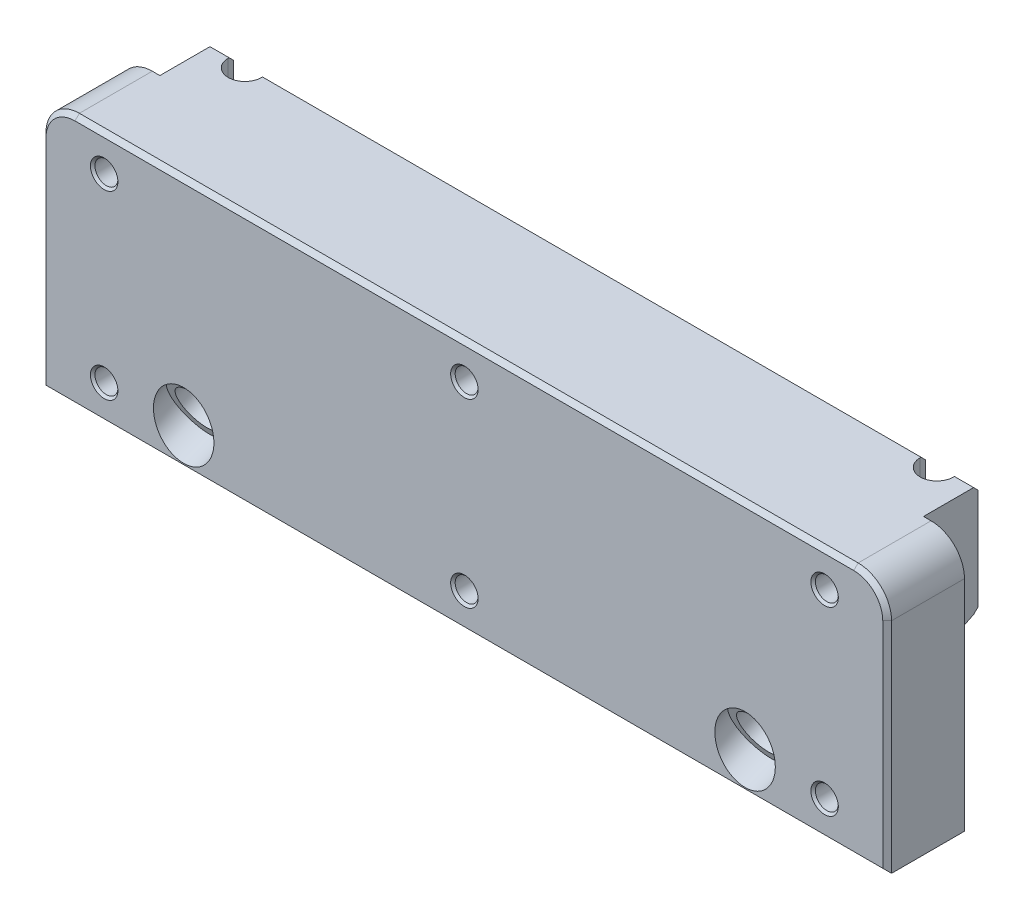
ISO-10303-21;
HEADER;
FILE_DESCRIPTION(('STEP AP214'),'2;1');
FILE_NAME('part.step','',(''),(''),'','','');
FILE_SCHEMA(('AUTOMOTIVE_DESIGN { 1 0 10303 214 1 1 1 1 }'));
ENDSEC;
DATA;
#1=APPLICATION_CONTEXT('core data for automotive mechanical design processes');
#2=APPLICATION_PROTOCOL_DEFINITION('international standard','automotive_design',2000,#1);
#3=PRODUCT_CONTEXT('',#1,'mechanical');
#4=PRODUCT('Part','Part','',(#3));
#5=PRODUCT_RELATED_PRODUCT_CATEGORY('part','',(#4));
#6=PRODUCT_DEFINITION_FORMATION('','',#4);
#7=PRODUCT_DEFINITION_CONTEXT('part definition',#1,'design');
#8=PRODUCT_DEFINITION('design','',#6,#7);
#9=PRODUCT_DEFINITION_SHAPE('','',#8);
#10=(LENGTH_UNIT() NAMED_UNIT(*) SI_UNIT(.MILLI.,.METRE.));
#11=(NAMED_UNIT(*) PLANE_ANGLE_UNIT() SI_UNIT($,.RADIAN.));
#12=(NAMED_UNIT(*) SI_UNIT($,.STERADIAN.) SOLID_ANGLE_UNIT());
#13=UNCERTAINTY_MEASURE_WITH_UNIT(LENGTH_MEASURE(1.E-05),#10,'distance_accuracy_value','');
#14=(GEOMETRIC_REPRESENTATION_CONTEXT(3) GLOBAL_UNCERTAINTY_ASSIGNED_CONTEXT((#13)) GLOBAL_UNIT_ASSIGNED_CONTEXT((#10,
#11,#12)) REPRESENTATION_CONTEXT('',''));
#15=CARTESIAN_POINT('',(0.,0.,0.));
#16=DIRECTION('',(0.,0.,1.));
#17=DIRECTION('',(1.,0.,0.));
#18=AXIS2_PLACEMENT_3D('',#15,#16,#17);
#19=CARTESIAN_POINT('',(0.,72.898,22.352));
#20=DIRECTION('',(0.,0.,-1.));
#21=DIRECTION('',(-1.,0.,0.));
#22=AXIS2_PLACEMENT_3D('',#19,#20,#21);
#23=PLANE('',#22);
#24=DIRECTION('',(0.999999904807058,-0.00043633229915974,0.));
#25=VECTOR('',#24,1.);
#26=CARTESIAN_POINT('',(-100.171250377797,62.6092683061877,22.352));
#27=LINE('',#26,#25);
#28=CARTESIAN_POINT('',(-100.170996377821,62.6092681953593,22.352));
#29=VERTEX_POINT('',#28);
#30=CARTESIAN_POINT('',(-100.171250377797,62.6092683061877,22.352));
#31=VERTEX_POINT('',#30);
#32=EDGE_CURVE('E526',#29,#31,#27,.F.);
#33=ORIENTED_EDGE('',*,*,#32,.F.);
#34=CARTESIAN_POINT('',(-104.14,62.611,22.352));
#35=DIRECTION('',(0.,0.,1.));
#36=DIRECTION('',(1.,0.,0.));
#37=AXIS2_PLACEMENT_3D('',#34,#35,#36);
#38=CIRCLE('',#37,3.969004);
#39=CARTESIAN_POINT('',(-100.170996,62.611,22.352));
#40=VERTEX_POINT('',#39);
#41=EDGE_CURVE('E477',#40,#29,#38,.T.);
#42=ORIENTED_EDGE('',*,*,#41,.F.);
#43=DIRECTION('',(1.,0.,0.));
#44=VECTOR('',#43,1.);
#45=CARTESIAN_POINT('',(-100.17125,62.611,22.352));
#46=LINE('',#45,#44);
#47=CARTESIAN_POINT('',(-100.17125,62.611,22.352));
#48=VERTEX_POINT('',#47);
#49=EDGE_CURVE('E40',#40,#48,#46,.F.);
#50=ORIENTED_EDGE('',*,*,#49,.T.);
#51=CARTESIAN_POINT('',(-104.14,62.611,22.352));
#52=DIRECTION('',(0.,0.,-1.));
#53=DIRECTION('',(-1.,0.,0.));
#54=AXIS2_PLACEMENT_3D('',#51,#52,#53);
#55=CIRCLE('',#54,3.96875);
#56=EDGE_CURVE('E765',#48,#31,#55,.T.);
#57=ORIENTED_EDGE('',*,*,#56,.T.);
#58=EDGE_LOOP('',(#33,#42,#50,#57));
#59=FACE_BOUND('',#58,.T.);
#60=DIRECTION('',(0.999999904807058,-0.000436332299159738,0.));
#61=VECTOR('',#60,1.);
#62=CARTESIAN_POINT('',(108.108749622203,62.6092683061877,22.352));
#63=LINE('',#62,#61);
#64=CARTESIAN_POINT('',(108.109003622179,62.6092681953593,22.352));
#65=VERTEX_POINT('',#64);
#66=CARTESIAN_POINT('',(108.108749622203,62.6092683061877,22.352));
#67=VERTEX_POINT('',#66);
#68=EDGE_CURVE('E2256',#65,#67,#63,.F.);
#69=ORIENTED_EDGE('',*,*,#68,.F.);
#70=CARTESIAN_POINT('',(104.14,62.611,22.352));
#71=DIRECTION('',(0.,0.,1.));
#72=DIRECTION('',(1.,0.,0.));
#73=AXIS2_PLACEMENT_3D('',#70,#71,#72);
#74=CIRCLE('',#73,3.969004);
#75=CARTESIAN_POINT('',(108.109004,62.611,22.352));
#76=VERTEX_POINT('',#75);
#77=EDGE_CURVE('E2181',#76,#65,#74,.T.);
#78=ORIENTED_EDGE('',*,*,#77,.F.);
#79=DIRECTION('',(1.,0.,0.));
#80=VECTOR('',#79,1.);
#81=CARTESIAN_POINT('',(108.10875,62.611,22.352));
#82=LINE('',#81,#80);
#83=CARTESIAN_POINT('',(108.10875,62.611,22.352));
#84=VERTEX_POINT('',#83);
#85=EDGE_CURVE('E2247',#76,#84,#82,.F.);
#86=ORIENTED_EDGE('',*,*,#85,.T.);
#87=CARTESIAN_POINT('',(104.14,62.611,22.352));
#88=DIRECTION('',(0.,0.,-1.));
#89=DIRECTION('',(-1.,0.,0.));
#90=AXIS2_PLACEMENT_3D('',#87,#88,#89);
#91=CIRCLE('',#90,3.96875);
#92=EDGE_CURVE('E755',#84,#67,#91,.T.);
#93=ORIENTED_EDGE('',*,*,#92,.T.);
#94=EDGE_LOOP('',(#69,#78,#86,#93));
#95=FACE_BOUND('',#94,.T.);
#96=DIRECTION('',(0.999999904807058,-0.000436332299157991,0.));
#97=VECTOR('',#96,1.);
#98=CARTESIAN_POINT('',(-100.171250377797,10.2852683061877,22.352));
#99=LINE('',#98,#97);
#100=CARTESIAN_POINT('',(-100.170996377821,10.2852681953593,22.352));
#101=VERTEX_POINT('',#100);
#102=CARTESIAN_POINT('',(-100.171250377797,10.2852683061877,22.352));
#103=VERTEX_POINT('',#102);
#104=EDGE_CURVE('E780',#101,#103,#99,.F.);
#105=ORIENTED_EDGE('',*,*,#104,.F.);
#106=CARTESIAN_POINT('',(-104.14,10.287,22.352));
#107=DIRECTION('',(0.,0.,1.));
#108=DIRECTION('',(1.,0.,0.));
#109=AXIS2_PLACEMENT_3D('',#106,#107,#108);
#110=CIRCLE('',#109,3.969004);
#111=CARTESIAN_POINT('',(-100.170996,10.287,22.352));
#112=VERTEX_POINT('',#111);
#113=EDGE_CURVE('E2378',#112,#101,#110,.T.);
#114=ORIENTED_EDGE('',*,*,#113,.F.);
#115=DIRECTION('',(1.,0.,0.));
#116=VECTOR('',#115,1.);
#117=CARTESIAN_POINT('',(-100.17125,10.287,22.352));
#118=LINE('',#117,#116);
#119=CARTESIAN_POINT('',(-100.17125,10.287,22.352));
#120=VERTEX_POINT('',#119);
#121=EDGE_CURVE('E784',#112,#120,#118,.F.);
#122=ORIENTED_EDGE('',*,*,#121,.T.);
#123=CARTESIAN_POINT('',(-104.14,10.287,22.352));
#124=DIRECTION('',(0.,0.,-1.));
#125=DIRECTION('',(-1.,0.,0.));
#126=AXIS2_PLACEMENT_3D('',#123,#124,#125);
#127=CIRCLE('',#126,3.96875);
#128=EDGE_CURVE('E750',#120,#103,#127,.T.);
#129=ORIENTED_EDGE('',*,*,#128,.T.);
#130=EDGE_LOOP('',(#105,#114,#122,#129));
#131=FACE_BOUND('',#130,.T.);
#132=DIRECTION('',(-1.,0.,0.));
#133=VECTOR('',#132,1.);
#134=CARTESIAN_POINT('',(0.,71.628,22.352));
#135=LINE('',#134,#133);
#136=CARTESIAN_POINT('',(112.5728,71.628,22.352));
#137=VERTEX_POINT('',#136);
#138=CARTESIAN_POINT('',(-112.5728,71.628,22.352));
#139=VERTEX_POINT('',#138);
#140=EDGE_CURVE('E999',#137,#139,#135,.T.);
#141=ORIENTED_EDGE('',*,*,#140,.T.);
#142=CARTESIAN_POINT('',(-112.5728,63.246,22.352));
#143=DIRECTION('',(0.,0.,-1.));
#144=DIRECTION('',(-1.,0.,0.));
#145=AXIS2_PLACEMENT_3D('',#142,#143,#144);
#146=CIRCLE('',#145,8.382);
#147=CARTESIAN_POINT('',(-120.9548,63.246,22.352));
#148=VERTEX_POINT('',#147);
#149=EDGE_CURVE('E1009',#139,#148,#146,.F.);
#150=ORIENTED_EDGE('',*,*,#149,.T.);
#151=DIRECTION('',(0.,-1.,0.));
#152=VECTOR('',#151,1.);
#153=CARTESIAN_POINT('',(-120.9548,0.,22.352));
#154=LINE('',#153,#152);
#155=CARTESIAN_POINT('',(-120.9548,1.27,22.352));
#156=VERTEX_POINT('',#155);
#157=EDGE_CURVE('E1007',#148,#156,#154,.T.);
#158=ORIENTED_EDGE('',*,*,#157,.T.);
#159=DIRECTION('',(1.,0.,0.));
#160=VECTOR('',#159,1.);
#161=CARTESIAN_POINT('',(122.2248,1.27,22.352));
#162=LINE('',#161,#160);
#163=CARTESIAN_POINT('',(120.9548,1.27,22.352));
#164=VERTEX_POINT('',#163);
#165=EDGE_CURVE('E1005',#156,#164,#162,.T.);
#166=ORIENTED_EDGE('',*,*,#165,.T.);
#167=DIRECTION('',(0.,1.,0.));
#168=VECTOR('',#167,1.);
#169=CARTESIAN_POINT('',(120.9548,72.898,22.352));
#170=LINE('',#169,#168);
#171=CARTESIAN_POINT('',(120.9548,63.246,22.352));
#172=VERTEX_POINT('',#171);
#173=EDGE_CURVE('E1003',#164,#172,#170,.T.);
#174=ORIENTED_EDGE('',*,*,#173,.T.);
#175=CARTESIAN_POINT('',(112.5728,63.246,22.352));
#176=DIRECTION('',(0.,0.,-1.));
#177=DIRECTION('',(-1.,0.,0.));
#178=AXIS2_PLACEMENT_3D('',#175,#176,#177);
#179=CIRCLE('',#178,8.382);
#180=EDGE_CURVE('E1001',#172,#137,#179,.F.);
#181=ORIENTED_EDGE('',*,*,#180,.T.);
#182=EDGE_LOOP('',(#141,#150,#158,#166,#174,#181));
#183=FACE_BOUND('',#182,.T.);
#184=CARTESIAN_POINT('',(-81.153,11.0937104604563,22.352));
#185=DIRECTION('',(0.,0.,-1.));
#186=DIRECTION('',(0.,1.,0.));
#187=AXIS2_PLACEMENT_3D('',#184,#185,#186);
#188=ELLIPSE('',#187,9.49218243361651,8.7376);
#189=CARTESIAN_POINT('',(-81.153,20.5858928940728,22.352));
#190=VERTEX_POINT('',#189);
#191=EDGE_CURVE('E881',#190,#190,#188,.F.);
#192=ORIENTED_EDGE('',*,*,#191,.F.);
#193=EDGE_LOOP('',(#192));
#194=FACE_BOUND('',#193,.T.);
#195=CARTESIAN_POINT('',(81.153,11.0937104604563,22.352));
#196=DIRECTION('',(0.,0.,-1.));
#197=DIRECTION('',(0.,1.,0.));
#198=AXIS2_PLACEMENT_3D('',#195,#196,#197);
#199=ELLIPSE('',#198,9.49218243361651,8.7376);
#200=CARTESIAN_POINT('',(81.153,20.5858928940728,22.352));
#201=VERTEX_POINT('',#200);
#202=EDGE_CURVE('E839',#201,#201,#199,.F.);
#203=ORIENTED_EDGE('',*,*,#202,.F.);
#204=EDGE_LOOP('',(#203));
#205=FACE_BOUND('',#204,.T.);
#206=DIRECTION('',(0.999999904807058,-0.000436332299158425,0.));
#207=VECTOR('',#206,1.);
#208=CARTESIAN_POINT('',(108.108749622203,10.2852683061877,22.352));
#209=LINE('',#208,#207);
#210=CARTESIAN_POINT('',(108.109003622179,10.2852681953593,22.352));
#211=VERTEX_POINT('',#210);
#212=CARTESIAN_POINT('',(108.108749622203,10.2852683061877,22.352));
#213=VERTEX_POINT('',#212);
#214=EDGE_CURVE('E2165',#211,#213,#209,.F.);
#215=ORIENTED_EDGE('',*,*,#214,.F.);
#216=CARTESIAN_POINT('',(104.14,10.287,22.352));
#217=DIRECTION('',(0.,0.,1.));
#218=DIRECTION('',(1.,0.,0.));
#219=AXIS2_PLACEMENT_3D('',#216,#217,#218);
#220=CIRCLE('',#219,3.969004);
#221=CARTESIAN_POINT('',(108.109004,10.287,22.352));
#222=VERTEX_POINT('',#221);
#223=EDGE_CURVE('E2473',#222,#211,#220,.T.);
#224=ORIENTED_EDGE('',*,*,#223,.F.);
#225=DIRECTION('',(1.,0.,0.));
#226=VECTOR('',#225,1.);
#227=CARTESIAN_POINT('',(108.10875,10.287,22.352));
#228=LINE('',#227,#226);
#229=CARTESIAN_POINT('',(108.10875,10.287,22.352));
#230=VERTEX_POINT('',#229);
#231=EDGE_CURVE('E2364',#222,#230,#228,.F.);
#232=ORIENTED_EDGE('',*,*,#231,.T.);
#233=CARTESIAN_POINT('',(104.14,10.287,22.352));
#234=DIRECTION('',(0.,0.,-1.));
#235=DIRECTION('',(-1.,0.,0.));
#236=AXIS2_PLACEMENT_3D('',#233,#234,#235);
#237=CIRCLE('',#236,3.96875);
#238=EDGE_CURVE('E532',#230,#213,#237,.T.);
#239=ORIENTED_EDGE('',*,*,#238,.T.);
#240=EDGE_LOOP('',(#215,#224,#232,#239));
#241=FACE_BOUND('',#240,.T.);
#242=DIRECTION('',(0.999999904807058,-0.000436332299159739,0.));
#243=VECTOR('',#242,1.);
#244=CARTESIAN_POINT('',(3.96874962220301,62.6092683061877,22.352));
#245=LINE('',#244,#243);
#246=CARTESIAN_POINT('',(3.96900362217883,62.6092681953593,22.352));
#247=VERTEX_POINT('',#246);
#248=CARTESIAN_POINT('',(3.96874962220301,62.6092683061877,22.352));
#249=VERTEX_POINT('',#248);
#250=EDGE_CURVE('E2170',#247,#249,#245,.F.);
#251=ORIENTED_EDGE('',*,*,#250,.F.);
#252=CARTESIAN_POINT('',(0.,62.611,22.352));
#253=DIRECTION('',(0.,0.,1.));
#254=DIRECTION('',(1.,0.,0.));
#255=AXIS2_PLACEMENT_3D('',#252,#253,#254);
#256=CIRCLE('',#255,3.969004);
#257=CARTESIAN_POINT('',(3.969004,62.611,22.352));
#258=VERTEX_POINT('',#257);
#259=EDGE_CURVE('E2173',#258,#247,#256,.T.);
#260=ORIENTED_EDGE('',*,*,#259,.F.);
#261=DIRECTION('',(1.,0.,0.));
#262=VECTOR('',#261,1.);
#263=CARTESIAN_POINT('',(3.96875,62.611,22.352));
#264=LINE('',#263,#262);
#265=CARTESIAN_POINT('',(3.96875,62.611,22.352));
#266=VERTEX_POINT('',#265);
#267=EDGE_CURVE('E2178',#258,#266,#264,.F.);
#268=ORIENTED_EDGE('',*,*,#267,.T.);
#269=CARTESIAN_POINT('',(0.,62.611,22.352));
#270=DIRECTION('',(0.,0.,-1.));
#271=DIRECTION('',(-1.,0.,0.));
#272=AXIS2_PLACEMENT_3D('',#269,#270,#271);
#273=CIRCLE('',#272,3.96875);
#274=EDGE_CURVE('E533',#266,#249,#273,.T.);
#275=ORIENTED_EDGE('',*,*,#274,.T.);
#276=EDGE_LOOP('',(#251,#260,#268,#275));
#277=FACE_BOUND('',#276,.T.);
#278=DIRECTION('',(0.999999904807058,-0.000436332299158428,0.));
#279=VECTOR('',#278,1.);
#280=CARTESIAN_POINT('',(3.96874962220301,10.2852683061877,22.352));
#281=LINE('',#280,#279);
#282=CARTESIAN_POINT('',(3.96900362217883,10.2852681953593,22.352));
#283=VERTEX_POINT('',#282);
#284=CARTESIAN_POINT('',(3.96874962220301,10.2852683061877,22.352));
#285=VERTEX_POINT('',#284);
#286=EDGE_CURVE('E499',#283,#285,#281,.F.);
#287=ORIENTED_EDGE('',*,*,#286,.F.);
#288=CARTESIAN_POINT('',(0.,10.287,22.352));
#289=DIRECTION('',(0.,0.,1.));
#290=DIRECTION('',(1.,0.,0.));
#291=AXIS2_PLACEMENT_3D('',#288,#289,#290);
#292=CIRCLE('',#291,3.969004);
#293=CARTESIAN_POINT('',(3.969004,10.287,22.352));
#294=VERTEX_POINT('',#293);
#295=EDGE_CURVE('E561',#294,#283,#292,.T.);
#296=ORIENTED_EDGE('',*,*,#295,.F.);
#297=DIRECTION('',(1.,0.,0.));
#298=VECTOR('',#297,1.);
#299=CARTESIAN_POINT('',(3.96875,10.287,22.352));
#300=LINE('',#299,#298);
#301=CARTESIAN_POINT('',(3.96875,10.287,22.352));
#302=VERTEX_POINT('',#301);
#303=EDGE_CURVE('E19',#294,#302,#300,.F.);
#304=ORIENTED_EDGE('',*,*,#303,.T.);
#305=CARTESIAN_POINT('',(0.,10.287,22.352));
#306=DIRECTION('',(0.,0.,-1.));
#307=DIRECTION('',(-1.,0.,0.));
#308=AXIS2_PLACEMENT_3D('',#305,#306,#307);
#309=CIRCLE('',#308,3.96875);
#310=EDGE_CURVE('E529',#302,#285,#309,.T.);
#311=ORIENTED_EDGE('',*,*,#310,.T.);
#312=EDGE_LOOP('',(#287,#296,#304,#311));
#313=FACE_BOUND('',#312,.T.);
#314=ADVANCED_FACE('F15',(#59,#95,#131,#183,#194,#205,#241,#277,#313),#23,.F.);
#315=CARTESIAN_POINT('',(110.3884,72.898,-15.748));
#316=DIRECTION('',(0.,0.,1.));
#317=DIRECTION('',(1.,0.,0.));
#318=AXIS2_PLACEMENT_3D('',#315,#316,#317);
#319=PLANE('',#318);
#320=DIRECTION('',(0.,-1.,0.));
#321=VECTOR('',#320,1.);
#322=CARTESIAN_POINT('',(-104.8512,72.898,-15.748));
#323=LINE('',#322,#321);
#324=CARTESIAN_POINT('',(-104.8512,71.628,-15.748));
#325=VERTEX_POINT('',#324);
#326=CARTESIAN_POINT('',(-104.8512,42.3653663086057,-15.748));
#327=VERTEX_POINT('',#326);
#328=EDGE_CURVE('E945',#325,#327,#323,.T.);
#329=ORIENTED_EDGE('',*,*,#328,.T.);
#330=DIRECTION('',(-1.,0.,0.));
#331=VECTOR('',#330,1.);
#332=CARTESIAN_POINT('',(110.3884,42.3653663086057,-15.748));
#333=LINE('',#332,#331);
#334=CARTESIAN_POINT('',(-110.3884,42.3653663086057,-15.748));
#335=VERTEX_POINT('',#334);
#336=EDGE_CURVE('E727',#327,#335,#333,.T.);
#337=ORIENTED_EDGE('',*,*,#336,.T.);
#338=DIRECTION('',(0.,-1.,0.));
#339=VECTOR('',#338,1.);
#340=CARTESIAN_POINT('',(-110.3884,72.898,-15.748));
#341=LINE('',#340,#339);
#342=CARTESIAN_POINT('',(-110.3884,71.628,-15.748));
#343=VERTEX_POINT('',#342);
#344=EDGE_CURVE('E862',#343,#335,#341,.T.);
#345=ORIENTED_EDGE('',*,*,#344,.F.);
#346=DIRECTION('',(1.,0.,0.));
#347=VECTOR('',#346,1.);
#348=CARTESIAN_POINT('',(110.3884,71.628,-15.748));
#349=LINE('',#348,#347);
#350=EDGE_CURVE('E985',#343,#325,#349,.T.);
#351=ORIENTED_EDGE('',*,*,#350,.T.);
#352=EDGE_LOOP('',(#329,#337,#345,#351));
#353=FACE_BOUND('',#352,.T.);
#354=ADVANCED_FACE('F598',(#353),#319,.F.);
#355=CARTESIAN_POINT('',(-110.3884,72.898,0.));
#356=DIRECTION('',(-1.,0.,0.));
#357=DIRECTION('',(0.,0.,1.));
#358=AXIS2_PLACEMENT_3D('',#355,#356,#357);
#359=PLANE('',#358);
#360=ORIENTED_EDGE('',*,*,#344,.T.);
#361=DIRECTION('',(0.,0.707106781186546,-0.707106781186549));
#362=VECTOR('',#361,1.);
#363=CARTESIAN_POINT('',(-110.3884,49.7576831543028,-23.1403168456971));
#364=LINE('',#363,#362);
#365=CARTESIAN_POINT('',(-110.3884,41.1009876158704,-14.4836213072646));
#366=VERTEX_POINT('',#365);
#367=EDGE_CURVE('E1021',#335,#366,#364,.F.);
#368=ORIENTED_EDGE('',*,*,#367,.T.);
#369=DIRECTION('',(0.,0.438371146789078,-0.898794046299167));
#370=VECTOR('',#369,1.);
#371=CARTESIAN_POINT('',(-110.3884,41.5047713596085,-15.3115006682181));
#372=LINE('',#371,#370);
#373=CARTESIAN_POINT('',(-110.3884,34.7326222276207,-1.42653728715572));
#374=VERTEX_POINT('',#373);
#375=EDGE_CURVE('E838',#374,#366,#372,.T.);
#376=ORIENTED_EDGE('',*,*,#375,.F.);
#377=CARTESIAN_POINT('',(-110.3884,32.4496853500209,-2.54));
#378=DIRECTION('',(-1.,0.,0.));
#379=DIRECTION('',(0.,0.,1.));
#380=AXIS2_PLACEMENT_3D('',#377,#378,#379);
#381=CIRCLE('',#380,2.54);
#382=CARTESIAN_POINT('',(-110.3884,32.4496853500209,0.));
#383=VERTEX_POINT('',#382);
#384=EDGE_CURVE('E960',#374,#383,#381,.F.);
#385=ORIENTED_EDGE('',*,*,#384,.T.);
#386=DIRECTION('',(0.,-1.,0.));
#387=VECTOR('',#386,1.);
#388=CARTESIAN_POINT('',(-110.3884,72.898,0.));
#389=LINE('',#388,#387);
#390=CARTESIAN_POINT('',(-110.3884,72.898,0.));
#391=VERTEX_POINT('',#390);
#392=EDGE_CURVE('E860',#391,#383,#389,.T.);
#393=ORIENTED_EDGE('',*,*,#392,.F.);
#394=DIRECTION('',(0.,0.,1.));
#395=VECTOR('',#394,1.);
#396=CARTESIAN_POINT('',(-110.3884,72.898,0.));
#397=LINE('',#396,#395);
#398=CARTESIAN_POINT('',(-110.3884,72.898,-14.478));
#399=VERTEX_POINT('',#398);
#400=EDGE_CURVE('E886',#399,#391,#397,.T.);
#401=ORIENTED_EDGE('',*,*,#400,.F.);
#402=DIRECTION('',(0.,0.707106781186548,0.707106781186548));
#403=VECTOR('',#402,1.);
#404=CARTESIAN_POINT('',(-110.3884,80.137,-7.239));
#405=LINE('',#404,#403);
#406=EDGE_CURVE('E983',#399,#343,#405,.F.);
#407=ORIENTED_EDGE('',*,*,#406,.T.);
#408=EDGE_LOOP('',(#360,#368,#376,#385,#393,#401,#407));
#409=FACE_BOUND('',#408,.T.);
#410=ADVANCED_FACE('F604',(#409),#359,.T.);
#411=CARTESIAN_POINT('',(-122.2248,72.898,22.352));
#412=DIRECTION('',(0.,-1.,0.));
#413=DIRECTION('',(0.,0.,-1.));
#414=AXIS2_PLACEMENT_3D('',#411,#412,#413);
#415=PLANE('',#414);
#416=DIRECTION('',(0.,0.,-1.));
#417=VECTOR('',#416,1.);
#418=CARTESIAN_POINT('',(110.3884,72.898,0.));
#419=LINE('',#418,#417);
#420=CARTESIAN_POINT('',(110.3884,72.898,0.));
#421=VERTEX_POINT('',#420);
#422=CARTESIAN_POINT('',(110.3884,72.898,-14.478));
#423=VERTEX_POINT('',#422);
#424=EDGE_CURVE('E850',#421,#423,#419,.T.);
#425=ORIENTED_EDGE('',*,*,#424,.T.);
#426=DIRECTION('',(-1.,0.,0.));
#427=VECTOR('',#426,1.);
#428=CARTESIAN_POINT('',(-122.2248,72.898,-14.478));
#429=LINE('',#428,#427);
#430=CARTESIAN_POINT('',(104.8512,72.898,-14.478));
#431=VERTEX_POINT('',#430);
#432=EDGE_CURVE('E973',#423,#431,#429,.T.);
#433=ORIENTED_EDGE('',*,*,#432,.T.);
#434=DIRECTION('',(0.,0.,1.));
#435=VECTOR('',#434,1.);
#436=CARTESIAN_POINT('',(104.8512,72.898,17.526));
#437=LINE('',#436,#435);
#438=CARTESIAN_POINT('',(104.8512,72.898,-14.224));
#439=VERTEX_POINT('',#438);
#440=EDGE_CURVE('E931',#431,#439,#437,.T.);
#441=ORIENTED_EDGE('',*,*,#440,.T.);
#442=CARTESIAN_POINT('',(100.0252,72.898,-14.224));
#443=DIRECTION('',(0.,-1.,0.));
#444=DIRECTION('',(0.,0.,-1.));
#445=AXIS2_PLACEMENT_3D('',#442,#443,#444);
#446=CIRCLE('',#445,4.826);
#447=CARTESIAN_POINT('',(95.1992,72.898,-14.224));
#448=VERTEX_POINT('',#447);
#449=EDGE_CURVE('E921',#439,#448,#446,.T.);
#450=ORIENTED_EDGE('',*,*,#449,.T.);
#451=DIRECTION('',(0.,0.,-1.));
#452=VECTOR('',#451,1.);
#453=CARTESIAN_POINT('',(95.1992,72.898,17.526));
#454=LINE('',#453,#452);
#455=CARTESIAN_POINT('',(95.1992,72.898,-14.478));
#456=VERTEX_POINT('',#455);
#457=EDGE_CURVE('E902',#448,#456,#454,.T.);
#458=ORIENTED_EDGE('',*,*,#457,.T.);
#459=DIRECTION('',(-1.,0.,0.));
#460=VECTOR('',#459,1.);
#461=CARTESIAN_POINT('',(-122.2248,72.898,-14.478));
#462=LINE('',#461,#460);
#463=CARTESIAN_POINT('',(-95.1992,72.898,-14.478));
#464=VERTEX_POINT('',#463);
#465=EDGE_CURVE('E967',#456,#464,#462,.T.);
#466=ORIENTED_EDGE('',*,*,#465,.T.);
#467=DIRECTION('',(0.,0.,1.));
#468=VECTOR('',#467,1.);
#469=CARTESIAN_POINT('',(-95.1992,72.898,17.526));
#470=LINE('',#469,#468);
#471=CARTESIAN_POINT('',(-95.1992,72.898,-14.224));
#472=VERTEX_POINT('',#471);
#473=EDGE_CURVE('E919',#464,#472,#470,.T.);
#474=ORIENTED_EDGE('',*,*,#473,.T.);
#475=CARTESIAN_POINT('',(-100.0252,72.898,-14.224));
#476=DIRECTION('',(0.,-1.,0.));
#477=DIRECTION('',(0.,0.,-1.));
#478=AXIS2_PLACEMENT_3D('',#475,#476,#477);
#479=CIRCLE('',#478,4.826);
#480=CARTESIAN_POINT('',(-104.8512,72.898,-14.224));
#481=VERTEX_POINT('',#480);
#482=EDGE_CURVE('E942',#472,#481,#479,.T.);
#483=ORIENTED_EDGE('',*,*,#482,.T.);
#484=DIRECTION('',(0.,0.,-1.));
#485=VECTOR('',#484,1.);
#486=CARTESIAN_POINT('',(-104.8512,72.898,17.526));
#487=LINE('',#486,#485);
#488=CARTESIAN_POINT('',(-104.8512,72.898,-14.478));
#489=VERTEX_POINT('',#488);
#490=EDGE_CURVE('E834',#489,#481,#487,.F.);
#491=ORIENTED_EDGE('',*,*,#490,.F.);
#492=DIRECTION('',(-1.,0.,0.));
#493=VECTOR('',#492,1.);
#494=CARTESIAN_POINT('',(-122.2248,72.898,-14.478));
#495=LINE('',#494,#493);
#496=EDGE_CURVE('E970',#489,#399,#495,.T.);
#497=ORIENTED_EDGE('',*,*,#496,.T.);
#498=ORIENTED_EDGE('',*,*,#400,.T.);
#499=DIRECTION('',(1.,0.,0.));
#500=VECTOR('',#499,1.);
#501=CARTESIAN_POINT('',(-122.2248,72.898,0.));
#502=LINE('',#501,#500);
#503=CARTESIAN_POINT('',(-112.5728,72.898,0.));
#504=VERTEX_POINT('',#503);
#505=EDGE_CURVE('E853',#504,#391,#502,.T.);
#506=ORIENTED_EDGE('',*,*,#505,.F.);
#507=DIRECTION('',(0.,0.,-1.));
#508=VECTOR('',#507,1.);
#509=CARTESIAN_POINT('',(-112.5728,72.898,22.352));
#510=LINE('',#509,#508);
#511=CARTESIAN_POINT('',(-112.5728,72.898,21.082));
#512=VERTEX_POINT('',#511);
#513=EDGE_CURVE('E859',#504,#512,#510,.F.);
#514=ORIENTED_EDGE('',*,*,#513,.T.);
#515=DIRECTION('',(1.,0.,0.));
#516=VECTOR('',#515,1.);
#517=CARTESIAN_POINT('',(-122.2248,72.898,21.082));
#518=LINE('',#517,#516);
#519=CARTESIAN_POINT('',(112.5728,72.898,21.082));
#520=VERTEX_POINT('',#519);
#521=EDGE_CURVE('E965',#512,#520,#518,.T.);
#522=ORIENTED_EDGE('',*,*,#521,.T.);
#523=DIRECTION('',(0.,0.,-1.));
#524=VECTOR('',#523,1.);
#525=CARTESIAN_POINT('',(112.5728,72.898,22.352));
#526=LINE('',#525,#524);
#527=CARTESIAN_POINT('',(112.5728,72.898,0.));
#528=VERTEX_POINT('',#527);
#529=EDGE_CURVE('E878',#520,#528,#526,.T.);
#530=ORIENTED_EDGE('',*,*,#529,.T.);
#531=DIRECTION('',(-1.,0.,0.));
#532=VECTOR('',#531,1.);
#533=CARTESIAN_POINT('',(122.2248,72.898,0.));
#534=LINE('',#533,#532);
#535=EDGE_CURVE('E847',#528,#421,#534,.T.);
#536=ORIENTED_EDGE('',*,*,#535,.T.);
#537=EDGE_LOOP('',(#425,#433,#441,#450,#458,#466,#474,#483,#491,#497,#498,#506,#514,#522,#530,#536));
#538=FACE_BOUND('',#537,.T.);
#539=ADVANCED_FACE('F613',(#538),#415,.F.);
#540=CARTESIAN_POINT('',(-104.8512,254.,-21.082));
#541=DIRECTION('',(-1.,0.,0.));
#542=DIRECTION('',(0.,0.,-1.));
#543=AXIS2_PLACEMENT_3D('',#540,#541,#542);
#544=PLANE('',#543);
#545=DIRECTION('',(0.,-0.438371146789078,0.898794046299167));
#546=VECTOR('',#545,1.);
#547=CARTESIAN_POINT('',(-104.8512,34.0368535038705,0.));
#548=LINE('',#547,#546);
#549=CARTESIAN_POINT('',(-104.8512,41.1009876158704,-14.4836213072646));
#550=VERTEX_POINT('',#549);
#551=CARTESIAN_POINT('',(-104.8512,40.97436009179,-14.2239964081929));
#552=VERTEX_POINT('',#551);
#553=EDGE_CURVE('E708',#550,#552,#548,.T.);
#554=ORIENTED_EDGE('',*,*,#553,.F.);
#555=DIRECTION('',(0.,-0.707106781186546,0.707106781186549));
#556=VECTOR('',#555,1.);
#557=CARTESIAN_POINT('',(-104.8512,42.3653663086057,-15.748));
#558=LINE('',#557,#556);
#559=EDGE_CURVE('E711',#550,#327,#558,.F.);
#560=ORIENTED_EDGE('',*,*,#559,.T.);
#561=ORIENTED_EDGE('',*,*,#328,.F.);
#562=DIRECTION('',(0.,-0.707106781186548,-0.707106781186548));
#563=VECTOR('',#562,1.);
#564=CARTESIAN_POINT('',(-104.8512,72.898,-14.478));
#565=LINE('',#564,#563);
#566=EDGE_CURVE('E987',#325,#489,#565,.F.);
#567=ORIENTED_EDGE('',*,*,#566,.T.);
#568=ORIENTED_EDGE('',*,*,#490,.T.);
#569=DIRECTION('',(0.,-1.,0.));
#570=VECTOR('',#569,1.);
#571=CARTESIAN_POINT('',(-104.8512,254.,-14.224));
#572=LINE('',#571,#570);
#573=EDGE_CURVE('E714',#481,#552,#572,.T.);
#574=ORIENTED_EDGE('',*,*,#573,.T.);
#575=EDGE_LOOP('',(#554,#560,#561,#567,#568,#574));
#576=FACE_BOUND('',#575,.T.);
#577=ADVANCED_FACE('F697',(#576),#544,.F.);
#578=DIRECTION('',(0.,-1.,0.));
#579=VECTOR('',#578,1.);
#580=CARTESIAN_POINT('',(95.1992,72.898,-15.748));
#581=LINE('',#580,#579);
#582=CARTESIAN_POINT('',(95.1992,71.628,-15.748));
#583=VERTEX_POINT('',#582);
#584=CARTESIAN_POINT('',(95.1992,42.3653663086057,-15.748));
#585=VERTEX_POINT('',#584);
#586=EDGE_CURVE('E933',#583,#585,#581,.T.);
#587=ORIENTED_EDGE('',*,*,#586,.T.);
#588=DIRECTION('',(-1.,0.,0.));
#589=VECTOR('',#588,1.);
#590=CARTESIAN_POINT('',(110.3884,42.3653663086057,-15.748));
#591=LINE('',#590,#589);
#592=CARTESIAN_POINT('',(-95.1992,42.3653663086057,-15.748));
#593=VERTEX_POINT('',#592);
#594=EDGE_CURVE('E728',#585,#593,#591,.T.);
#595=ORIENTED_EDGE('',*,*,#594,.T.);
#596=DIRECTION('',(0.,1.,0.));
#597=VECTOR('',#596,1.);
#598=CARTESIAN_POINT('',(-95.1992,72.898,-15.748));
#599=LINE('',#598,#597);
#600=CARTESIAN_POINT('',(-95.1992,71.628,-15.748));
#601=VERTEX_POINT('',#600);
#602=EDGE_CURVE('E943',#593,#601,#599,.T.);
#603=ORIENTED_EDGE('',*,*,#602,.T.);
#604=DIRECTION('',(1.,0.,0.));
#605=VECTOR('',#604,1.);
#606=CARTESIAN_POINT('',(110.3884,71.628,-15.748));
#607=LINE('',#606,#605);
#608=EDGE_CURVE('E992',#601,#583,#607,.T.);
#609=ORIENTED_EDGE('',*,*,#608,.T.);
#610=EDGE_LOOP('',(#587,#595,#603,#609));
#611=FACE_BOUND('',#610,.T.);
#612=ADVANCED_FACE('F607',(#611),#319,.F.);
#613=CARTESIAN_POINT('',(-122.2248,0.,22.352));
#614=DIRECTION('',(0.,-1.,0.));
#615=DIRECTION('',(0.,0.,-1.));
#616=AXIS2_PLACEMENT_3D('',#613,#614,#615);
#617=PLANE('',#616);
#618=DIRECTION('',(0.,0.,-1.));
#619=VECTOR('',#618,1.);
#620=CARTESIAN_POINT('',(122.2248,0.,22.352));
#621=LINE('',#620,#619);
#622=CARTESIAN_POINT('',(122.2248,0.,21.082));
#623=VERTEX_POINT('',#622);
#624=CARTESIAN_POINT('',(122.2248,0.,0.));
#625=VERTEX_POINT('',#624);
#626=EDGE_CURVE('E846',#623,#625,#621,.T.);
#627=ORIENTED_EDGE('',*,*,#626,.F.);
#628=DIRECTION('',(-1.,0.,0.));
#629=VECTOR('',#628,1.);
#630=CARTESIAN_POINT('',(-122.2248,0.,21.082));
#631=LINE('',#630,#629);
#632=CARTESIAN_POINT('',(-122.2248,0.,21.082));
#633=VERTEX_POINT('',#632);
#634=EDGE_CURVE('E1014',#623,#633,#631,.T.);
#635=ORIENTED_EDGE('',*,*,#634,.T.);
#636=DIRECTION('',(0.,0.,-1.));
#637=VECTOR('',#636,1.);
#638=CARTESIAN_POINT('',(-122.2248,0.,22.352));
#639=LINE('',#638,#637);
#640=CARTESIAN_POINT('',(-122.2248,0.,0.));
#641=VERTEX_POINT('',#640);
#642=EDGE_CURVE('E842',#633,#641,#639,.T.);
#643=ORIENTED_EDGE('',*,*,#642,.T.);
#644=DIRECTION('',(-1.,0.,0.));
#645=VECTOR('',#644,1.);
#646=CARTESIAN_POINT('',(122.2248,0.,0.));
#647=LINE('',#646,#645);
#648=EDGE_CURVE('E843',#625,#641,#647,.T.);
#649=ORIENTED_EDGE('',*,*,#648,.F.);
#650=EDGE_LOOP('',(#627,#635,#643,#649));
#651=FACE_BOUND('',#650,.T.);
#652=ADVANCED_FACE('F627',(#651),#617,.T.);
#653=CARTESIAN_POINT('',(110.3884,72.898,0.));
#654=DIRECTION('',(-1.,0.,0.));
#655=DIRECTION('',(0.,0.,1.));
#656=AXIS2_PLACEMENT_3D('',#653,#654,#655);
#657=PLANE('',#656);
#658=DIRECTION('',(0.,0.438371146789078,-0.898794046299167));
#659=VECTOR('',#658,1.);
#660=CARTESIAN_POINT('',(110.3884,41.5047713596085,-15.3115006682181));
#661=LINE('',#660,#659);
#662=CARTESIAN_POINT('',(110.3884,34.7326222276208,-1.42653728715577));
#663=VERTEX_POINT('',#662);
#664=CARTESIAN_POINT('',(110.3884,41.1009876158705,-14.4836213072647));
#665=VERTEX_POINT('',#664);
#666=EDGE_CURVE('E835',#663,#665,#661,.T.);
#667=ORIENTED_EDGE('',*,*,#666,.T.);
#668=DIRECTION('',(0.,-0.707106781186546,0.707106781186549));
#669=VECTOR('',#668,1.);
#670=CARTESIAN_POINT('',(110.3884,42.3653663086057,-15.748));
#671=LINE('',#670,#669);
#672=CARTESIAN_POINT('',(110.3884,42.3653663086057,-15.748));
#673=VERTEX_POINT('',#672);
#674=EDGE_CURVE('E745',#665,#673,#671,.F.);
#675=ORIENTED_EDGE('',*,*,#674,.T.);
#676=DIRECTION('',(0.,-1.,0.));
#677=VECTOR('',#676,1.);
#678=CARTESIAN_POINT('',(110.3884,72.898,-15.748));
#679=LINE('',#678,#677);
#680=CARTESIAN_POINT('',(110.3884,71.628,-15.748));
#681=VERTEX_POINT('',#680);
#682=EDGE_CURVE('E865',#681,#673,#679,.T.);
#683=ORIENTED_EDGE('',*,*,#682,.F.);
#684=DIRECTION('',(0.,-0.707106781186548,-0.707106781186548));
#685=VECTOR('',#684,1.);
#686=CARTESIAN_POINT('',(110.3884,72.898,-14.478));
#687=LINE('',#686,#685);
#688=EDGE_CURVE('E981',#681,#423,#687,.F.);
#689=ORIENTED_EDGE('',*,*,#688,.T.);
#690=ORIENTED_EDGE('',*,*,#424,.F.);
#691=DIRECTION('',(0.,-1.,0.));
#692=VECTOR('',#691,1.);
#693=CARTESIAN_POINT('',(110.3884,72.898,0.));
#694=LINE('',#693,#692);
#695=CARTESIAN_POINT('',(110.3884,32.4496853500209,0.));
#696=VERTEX_POINT('',#695);
#697=EDGE_CURVE('E868',#421,#696,#694,.T.);
#698=ORIENTED_EDGE('',*,*,#697,.T.);
#699=CARTESIAN_POINT('',(110.3884,32.4496853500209,-2.54));
#700=DIRECTION('',(-1.,0.,0.));
#701=DIRECTION('',(0.,0.,1.));
#702=AXIS2_PLACEMENT_3D('',#699,#700,#701);
#703=CIRCLE('',#702,2.54);
#704=EDGE_CURVE('E963',#696,#663,#703,.T.);
#705=ORIENTED_EDGE('',*,*,#704,.T.);
#706=EDGE_LOOP('',(#667,#675,#683,#689,#690,#698,#705));
#707=FACE_BOUND('',#706,.T.);
#708=ADVANCED_FACE('F625',(#707),#657,.F.);
#709=ORIENTED_EDGE('',*,*,#682,.T.);
#710=DIRECTION('',(-1.,0.,0.));
#711=VECTOR('',#710,1.);
#712=CARTESIAN_POINT('',(110.3884,42.3653663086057,-15.748));
#713=LINE('',#712,#711);
#714=CARTESIAN_POINT('',(104.8512,42.3653663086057,-15.748));
#715=VERTEX_POINT('',#714);
#716=EDGE_CURVE('E740',#673,#715,#713,.T.);
#717=ORIENTED_EDGE('',*,*,#716,.T.);
#718=DIRECTION('',(0.,1.,0.));
#719=VECTOR('',#718,1.);
#720=CARTESIAN_POINT('',(104.8512,72.898,-15.748));
#721=LINE('',#720,#719);
#722=CARTESIAN_POINT('',(104.8512,71.628,-15.748));
#723=VERTEX_POINT('',#722);
#724=EDGE_CURVE('E929',#715,#723,#721,.T.);
#725=ORIENTED_EDGE('',*,*,#724,.T.);
#726=DIRECTION('',(1.,0.,0.));
#727=VECTOR('',#726,1.);
#728=CARTESIAN_POINT('',(110.3884,71.628,-15.748));
#729=LINE('',#728,#727);
#730=EDGE_CURVE('E979',#723,#681,#729,.T.);
#731=ORIENTED_EDGE('',*,*,#730,.T.);
#732=EDGE_LOOP('',(#709,#717,#725,#731));
#733=FACE_BOUND('',#732,.T.);
#734=ADVANCED_FACE('F608',(#733),#319,.F.);
#735=CARTESIAN_POINT('',(-122.2248,72.898,22.352));
#736=DIRECTION('',(-1.,0.,0.));
#737=DIRECTION('',(0.,0.,1.));
#738=AXIS2_PLACEMENT_3D('',#735,#736,#737);
#739=PLANE('',#738);
#740=ORIENTED_EDGE('',*,*,#642,.F.);
#741=DIRECTION('',(0.,1.,0.));
#742=VECTOR('',#741,1.);
#743=CARTESIAN_POINT('',(-122.2248,63.246,21.082));
#744=LINE('',#743,#742);
#745=CARTESIAN_POINT('',(-122.2248,63.246,21.082));
#746=VERTEX_POINT('',#745);
#747=EDGE_CURVE('E1012',#633,#746,#744,.T.);
#748=ORIENTED_EDGE('',*,*,#747,.T.);
#749=DIRECTION('',(0.,0.,-1.));
#750=VECTOR('',#749,1.);
#751=CARTESIAN_POINT('',(-122.2248,63.246,0.));
#752=LINE('',#751,#750);
#753=CARTESIAN_POINT('',(-122.2248,63.246,0.));
#754=VERTEX_POINT('',#753);
#755=EDGE_CURVE('E907',#746,#754,#752,.T.);
#756=ORIENTED_EDGE('',*,*,#755,.T.);
#757=DIRECTION('',(0.,-1.,0.));
#758=VECTOR('',#757,1.);
#759=CARTESIAN_POINT('',(-122.2248,72.898,0.));
#760=LINE('',#759,#758);
#761=EDGE_CURVE('E856',#754,#641,#760,.T.);
#762=ORIENTED_EDGE('',*,*,#761,.T.);
#763=EDGE_LOOP('',(#740,#748,#756,#762));
#764=FACE_BOUND('',#763,.T.);
#765=ADVANCED_FACE('F623',(#764),#739,.T.);
#766=CARTESIAN_POINT('',(122.2248,72.898,0.));
#767=DIRECTION('',(0.,0.,1.));
#768=DIRECTION('',(1.,0.,0.));
#769=AXIS2_PLACEMENT_3D('',#766,#767,#768);
#770=PLANE('',#769);
#771=CARTESIAN_POINT('',(-81.153,20.5815715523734,0.));
#772=DIRECTION('',(0.,0.,1.));
#773=DIRECTION('',(0.,-1.,0.));
#774=AXIS2_PLACEMENT_3D('',#771,#772,#773);
#775=ELLIPSE('',#774,6.90528678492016,6.35635);
#776=CARTESIAN_POINT('',(-81.153,13.6762847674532,0.));
#777=VERTEX_POINT('',#776);
#778=EDGE_CURVE('E889',#777,#777,#775,.T.);
#779=ORIENTED_EDGE('',*,*,#778,.T.);
#780=EDGE_LOOP('',(#779));
#781=FACE_BOUND('',#780,.T.);
#782=CARTESIAN_POINT('',(81.153,20.5815715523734,0.));
#783=DIRECTION('',(0.,0.,1.));
#784=DIRECTION('',(0.,-1.,0.));
#785=AXIS2_PLACEMENT_3D('',#782,#783,#784);
#786=ELLIPSE('',#785,6.90528678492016,6.35635);
#787=CARTESIAN_POINT('',(81.153,13.6762847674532,0.));
#788=VERTEX_POINT('',#787);
#789=EDGE_CURVE('E893',#788,#788,#786,.T.);
#790=ORIENTED_EDGE('',*,*,#789,.T.);
#791=EDGE_LOOP('',(#790));
#792=FACE_BOUND('',#791,.T.);
#793=ORIENTED_EDGE('',*,*,#392,.T.);
#794=DIRECTION('',(-1.,0.,0.));
#795=VECTOR('',#794,1.);
#796=CARTESIAN_POINT('',(110.3884,32.4496853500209,0.));
#797=LINE('',#796,#795);
#798=EDGE_CURVE('E957',#383,#696,#797,.F.);
#799=ORIENTED_EDGE('',*,*,#798,.T.);
#800=ORIENTED_EDGE('',*,*,#697,.F.);
#801=ORIENTED_EDGE('',*,*,#535,.F.);
#802=CARTESIAN_POINT('',(112.5728,63.246,0.));
#803=DIRECTION('',(0.,0.,1.));
#804=DIRECTION('',(1.,0.,0.));
#805=AXIS2_PLACEMENT_3D('',#802,#803,#804);
#806=CIRCLE('',#805,9.652);
#807=CARTESIAN_POINT('',(122.2248,63.246,0.));
#808=VERTEX_POINT('',#807);
#809=EDGE_CURVE('E877',#528,#808,#806,.F.);
#810=ORIENTED_EDGE('',*,*,#809,.T.);
#811=DIRECTION('',(0.,-1.,0.));
#812=VECTOR('',#811,1.);
#813=CARTESIAN_POINT('',(122.2248,72.898,0.));
#814=LINE('',#813,#812);
#815=EDGE_CURVE('E849',#808,#625,#814,.T.);
#816=ORIENTED_EDGE('',*,*,#815,.T.);
#817=ORIENTED_EDGE('',*,*,#648,.T.);
#818=ORIENTED_EDGE('',*,*,#761,.F.);
#819=CARTESIAN_POINT('',(-112.5728,63.246,0.));
#820=DIRECTION('',(0.,0.,1.));
#821=DIRECTION('',(1.,0.,0.));
#822=AXIS2_PLACEMENT_3D('',#819,#820,#821);
#823=CIRCLE('',#822,9.652);
#824=EDGE_CURVE('E875',#754,#504,#823,.F.);
#825=ORIENTED_EDGE('',*,*,#824,.T.);
#826=ORIENTED_EDGE('',*,*,#505,.T.);
#827=EDGE_LOOP('',(#793,#799,#800,#801,#810,#816,#817,#818,#825,#826));
#828=FACE_BOUND('',#827,.T.);
#829=ADVANCED_FACE('F619',(#781,#792,#828),#770,.F.);
#830=CARTESIAN_POINT('',(122.2248,72.898,22.352));
#831=DIRECTION('',(-1.,0.,0.));
#832=DIRECTION('',(0.,0.,1.));
#833=AXIS2_PLACEMENT_3D('',#830,#831,#832);
#834=PLANE('',#833);
#835=DIRECTION('',(0.,0.,-1.));
#836=VECTOR('',#835,1.);
#837=CARTESIAN_POINT('',(122.2248,63.246,22.352));
#838=LINE('',#837,#836);
#839=CARTESIAN_POINT('',(122.2248,63.246,21.082));
#840=VERTEX_POINT('',#839);
#841=EDGE_CURVE('E880',#808,#840,#838,.F.);
#842=ORIENTED_EDGE('',*,*,#841,.T.);
#843=DIRECTION('',(0.,-1.,0.));
#844=VECTOR('',#843,1.);
#845=CARTESIAN_POINT('',(122.2248,72.898,21.082));
#846=LINE('',#845,#844);
#847=EDGE_CURVE('E1016',#840,#623,#846,.T.);
#848=ORIENTED_EDGE('',*,*,#847,.T.);
#849=ORIENTED_EDGE('',*,*,#626,.T.);
#850=ORIENTED_EDGE('',*,*,#815,.F.);
#851=EDGE_LOOP('',(#842,#848,#849,#850));
#852=FACE_BOUND('',#851,.T.);
#853=ADVANCED_FACE('F615',(#852),#834,.F.);
#854=CARTESIAN_POINT('',(470.021429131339,34.0368535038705,0.));
#855=DIRECTION('',(0.,0.898794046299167,0.438371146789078));
#856=DIRECTION('',(0.,-0.438371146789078,0.898794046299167));
#857=AXIS2_PLACEMENT_3D('',#854,#855,#856);
#858=PLANE('',#857);
#859=ORIENTED_EDGE('',*,*,#375,.T.);
#860=DIRECTION('',(1.,0.,0.));
#861=VECTOR('',#860,1.);
#862=CARTESIAN_POINT('',(470.021429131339,41.1009876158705,-14.4836213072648));
#863=LINE('',#862,#861);
#864=EDGE_CURVE('E725',#366,#550,#863,.T.);
#865=ORIENTED_EDGE('',*,*,#864,.T.);
#866=ORIENTED_EDGE('',*,*,#553,.T.);
#867=CARTESIAN_POINT('',(-100.0252,40.9743618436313,-14.224));
#868=DIRECTION('',(0.,0.898794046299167,0.438371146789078));
#869=DIRECTION('',(0.,-0.438371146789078,0.898794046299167));
#870=AXIS2_PLACEMENT_3D('',#867,#868,#869);
#871=ELLIPSE('',#870,5.36941696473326,4.826);
#872=CARTESIAN_POINT('',(-95.1992,40.974360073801,-14.2239963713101));
#873=VERTEX_POINT('',#872);
#874=EDGE_CURVE('E719',#552,#873,#871,.T.);
#875=ORIENTED_EDGE('',*,*,#874,.T.);
#876=DIRECTION('',(0.,0.438371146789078,-0.898794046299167));
#877=VECTOR('',#876,1.);
#878=CARTESIAN_POINT('',(-95.1992,34.0368535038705,0.));
#879=LINE('',#878,#877);
#880=CARTESIAN_POINT('',(-95.1992,41.1009876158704,-14.4836213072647));
#881=VERTEX_POINT('',#880);
#882=EDGE_CURVE('E718',#873,#881,#879,.T.);
#883=ORIENTED_EDGE('',*,*,#882,.T.);
#884=DIRECTION('',(1.,0.,0.));
#885=VECTOR('',#884,1.);
#886=CARTESIAN_POINT('',(470.021429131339,41.1009876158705,-14.4836213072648));
#887=LINE('',#886,#885);
#888=CARTESIAN_POINT('',(95.1992,41.1009876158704,-14.4836213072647));
#889=VERTEX_POINT('',#888);
#890=EDGE_CURVE('E733',#881,#889,#887,.T.);
#891=ORIENTED_EDGE('',*,*,#890,.T.);
#892=DIRECTION('',(0.,-0.438371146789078,0.898794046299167));
#893=VECTOR('',#892,1.);
#894=CARTESIAN_POINT('',(95.1992,34.0368535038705,0.));
#895=LINE('',#894,#893);
#896=CARTESIAN_POINT('',(95.1992,40.974360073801,-14.2239963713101));
#897=VERTEX_POINT('',#896);
#898=EDGE_CURVE('E922',#889,#897,#895,.T.);
#899=ORIENTED_EDGE('',*,*,#898,.T.);
#900=CARTESIAN_POINT('',(100.0252,40.9743618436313,-14.224));
#901=DIRECTION('',(0.,0.898794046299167,0.438371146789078));
#902=DIRECTION('',(0.,-0.438371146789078,0.898794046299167));
#903=AXIS2_PLACEMENT_3D('',#900,#901,#902);
#904=ELLIPSE('',#903,5.36941696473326,4.826);
#905=CARTESIAN_POINT('',(104.8512,40.97436009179,-14.2239964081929));
#906=VERTEX_POINT('',#905);
#907=EDGE_CURVE('E911',#897,#906,#904,.T.);
#908=ORIENTED_EDGE('',*,*,#907,.T.);
#909=DIRECTION('',(0.,0.438371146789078,-0.898794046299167));
#910=VECTOR('',#909,1.);
#911=CARTESIAN_POINT('',(104.8512,34.0368535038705,0.));
#912=LINE('',#911,#910);
#913=CARTESIAN_POINT('',(104.8512,41.1009876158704,-14.4836213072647));
#914=VERTEX_POINT('',#913);
#915=EDGE_CURVE('E924',#906,#914,#912,.T.);
#916=ORIENTED_EDGE('',*,*,#915,.T.);
#917=DIRECTION('',(1.,0.,0.));
#918=VECTOR('',#917,1.);
#919=CARTESIAN_POINT('',(470.021429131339,41.1009876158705,-14.4836213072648));
#920=LINE('',#919,#918);
#921=EDGE_CURVE('E1023',#914,#665,#920,.T.);
#922=ORIENTED_EDGE('',*,*,#921,.T.);
#923=ORIENTED_EDGE('',*,*,#666,.F.);
#924=DIRECTION('',(-1.,0.,0.));
#925=VECTOR('',#924,1.);
#926=CARTESIAN_POINT('',(-110.3884,34.7326222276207,-1.42653728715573));
#927=LINE('',#926,#925);
#928=EDGE_CURVE('E954',#663,#374,#927,.T.);
#929=ORIENTED_EDGE('',*,*,#928,.T.);
#930=EDGE_LOOP('',(#859,#865,#866,#875,#883,#891,#899,#908,#916,#922,#923,#929));
#931=FACE_BOUND('',#930,.T.);
#932=ADVANCED_FACE('F618',(#931),#858,.F.);
#933=CARTESIAN_POINT('',(81.153,2.48561801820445,42.6313949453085));
#934=DIRECTION('',(0.,0.390731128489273,-0.92050485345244));
#935=DIRECTION('',(0.,0.92050485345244,0.390731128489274));
#936=AXIS2_PLACEMENT_3D('',#933,#934,#935);
#937=CYLINDRICAL_SURFACE('',#936,8.7376);
#938=CARTESIAN_POINT('',(81.153,12.9299483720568,18.0260945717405));
#939=DIRECTION('',(0.,-0.390731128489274,0.920504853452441));
#940=DIRECTION('',(0.,-0.92050485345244,-0.390731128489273));
#941=AXIS2_PLACEMENT_3D('',#938,#939,#940);
#942=CIRCLE('',#941,8.7376);
#943=CARTESIAN_POINT('',(81.153,4.8869451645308,14.6120422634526));
#944=VERTEX_POINT('',#943);
#945=EDGE_CURVE('E874',#944,#944,#942,.T.);
#946=ORIENTED_EDGE('',*,*,#945,.F.);
#947=EDGE_LOOP('',(#946));
#948=FACE_BOUND('',#947,.T.);
#949=ORIENTED_EDGE('',*,*,#202,.T.);
#950=EDGE_LOOP('',(#949));
#951=FACE_BOUND('',#950,.T.);
#952=ADVANCED_FACE('F652',(#948,#951),#937,.F.);
#953=CARTESIAN_POINT('',(81.153,12.9299483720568,18.0260945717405));
#954=DIRECTION('',(0.,-0.390731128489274,0.920504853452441));
#955=DIRECTION('',(0.,-0.92050485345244,-0.390731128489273));
#956=AXIS2_PLACEMENT_3D('',#953,#954,#955);
#957=PLANE('',#956);
#958=CARTESIAN_POINT('',(81.153,12.9299483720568,18.0260945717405));
#959=DIRECTION('',(0.,-0.390731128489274,0.920504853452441));
#960=DIRECTION('',(0.,-0.92050485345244,-0.390731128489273));
#961=AXIS2_PLACEMENT_3D('',#958,#959,#960);
#962=CIRCLE('',#961,6.35635);
#963=CARTESIAN_POINT('',(81.153,7.0788973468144,15.5424707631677));
#964=VERTEX_POINT('',#963);
#965=EDGE_CURVE('E884',#964,#964,#962,.T.);
#966=ORIENTED_EDGE('',*,*,#965,.F.);
#967=EDGE_LOOP('',(#966));
#968=FACE_BOUND('',#967,.T.);
#969=ORIENTED_EDGE('',*,*,#945,.T.);
#970=EDGE_LOOP('',(#969));
#971=FACE_BOUND('',#970,.T.);
#972=ADVANCED_FACE('F648',(#968,#971),#957,.T.);
#973=CARTESIAN_POINT('',(81.153,22.3347593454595,-4.13025161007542));
#974=DIRECTION('',(0.,-0.390731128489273,0.92050485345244));
#975=DIRECTION('',(0.,-0.92050485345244,-0.390731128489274));
#976=AXIS2_PLACEMENT_3D('',#973,#974,#975);
#977=CYLINDRICAL_SURFACE('',#976,6.35635);
#978=ORIENTED_EDGE('',*,*,#965,.T.);
#979=EDGE_LOOP('',(#978));
#980=FACE_BOUND('',#979,.T.);
#981=ORIENTED_EDGE('',*,*,#789,.F.);
#982=EDGE_LOOP('',(#981));
#983=FACE_BOUND('',#982,.T.);
#984=ADVANCED_FACE('F644',(#980,#983),#977,.F.);
#985=CARTESIAN_POINT('',(112.5728,63.246,22.352));
#986=DIRECTION('',(0.,0.,-1.));
#987=DIRECTION('',(-1.,0.,0.));
#988=AXIS2_PLACEMENT_3D('',#985,#986,#987);
#989=CYLINDRICAL_SURFACE('',#988,9.652);
#990=ORIENTED_EDGE('',*,*,#529,.F.);
#991=CARTESIAN_POINT('',(112.5728,63.246,21.082));
#992=DIRECTION('',(0.,0.,-1.));
#993=DIRECTION('',(-1.,0.,0.));
#994=AXIS2_PLACEMENT_3D('',#991,#992,#993);
#995=CIRCLE('',#994,9.652);
#996=EDGE_CURVE('E1018',#520,#840,#995,.T.);
#997=ORIENTED_EDGE('',*,*,#996,.T.);
#998=ORIENTED_EDGE('',*,*,#841,.F.);
#999=ORIENTED_EDGE('',*,*,#809,.F.);
#1000=EDGE_LOOP('',(#990,#997,#998,#999));
#1001=FACE_BOUND('',#1000,.T.);
#1002=ADVANCED_FACE('F647',(#1001),#989,.T.);
#1003=CARTESIAN_POINT('',(-112.5728,63.246,22.352));
#1004=DIRECTION('',(0.,0.,1.));
#1005=DIRECTION('',(1.,0.,0.));
#1006=AXIS2_PLACEMENT_3D('',#1003,#1004,#1005);
#1007=CYLINDRICAL_SURFACE('',#1006,9.652);
#1008=ORIENTED_EDGE('',*,*,#755,.F.);
#1009=CARTESIAN_POINT('',(-112.5728,63.246,21.082));
#1010=DIRECTION('',(0.,0.,-1.));
#1011=DIRECTION('',(-1.,0.,0.));
#1012=AXIS2_PLACEMENT_3D('',#1009,#1010,#1011);
#1013=CIRCLE('',#1012,9.652);
#1014=EDGE_CURVE('E996',#746,#512,#1013,.T.);
#1015=ORIENTED_EDGE('',*,*,#1014,.T.);
#1016=ORIENTED_EDGE('',*,*,#513,.F.);
#1017=ORIENTED_EDGE('',*,*,#824,.F.);
#1018=EDGE_LOOP('',(#1008,#1015,#1016,#1017));
#1019=FACE_BOUND('',#1018,.T.);
#1020=ADVANCED_FACE('F1950',(#1019),#1007,.T.);
#1021=CARTESIAN_POINT('',(-81.153,2.48561801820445,42.6313949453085));
#1022=DIRECTION('',(0.,0.390731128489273,-0.92050485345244));
#1023=DIRECTION('',(0.,0.92050485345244,0.390731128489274));
#1024=AXIS2_PLACEMENT_3D('',#1021,#1022,#1023);
#1025=CYLINDRICAL_SURFACE('',#1024,8.7376);
#1026=CARTESIAN_POINT('',(-81.153,12.9299483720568,18.0260945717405));
#1027=DIRECTION('',(0.,-0.390731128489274,0.920504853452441));
#1028=DIRECTION('',(0.,-0.92050485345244,-0.390731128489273));
#1029=AXIS2_PLACEMENT_3D('',#1026,#1027,#1028);
#1030=CIRCLE('',#1029,8.7376);
#1031=CARTESIAN_POINT('',(-81.153,4.8869451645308,14.6120422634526));
#1032=VERTEX_POINT('',#1031);
#1033=EDGE_CURVE('E885',#1032,#1032,#1030,.F.);
#1034=ORIENTED_EDGE('',*,*,#1033,.T.);
#1035=EDGE_LOOP('',(#1034));
#1036=FACE_BOUND('',#1035,.T.);
#1037=ORIENTED_EDGE('',*,*,#191,.T.);
#1038=EDGE_LOOP('',(#1037));
#1039=FACE_BOUND('',#1038,.T.);
#1040=ADVANCED_FACE('F656',(#1036,#1039),#1025,.F.);
#1041=CARTESIAN_POINT('',(-81.153,12.9299483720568,18.0260945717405));
#1042=DIRECTION('',(0.,-0.390731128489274,0.920504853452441));
#1043=DIRECTION('',(0.,-0.92050485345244,-0.390731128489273));
#1044=AXIS2_PLACEMENT_3D('',#1041,#1042,#1043);
#1045=PLANE('',#1044);
#1046=CARTESIAN_POINT('',(-81.153,12.9299483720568,18.0260945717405));
#1047=DIRECTION('',(0.,-0.390731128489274,0.920504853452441));
#1048=DIRECTION('',(0.,-0.92050485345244,-0.390731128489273));
#1049=AXIS2_PLACEMENT_3D('',#1046,#1047,#1048);
#1050=CIRCLE('',#1049,6.35635);
#1051=CARTESIAN_POINT('',(-81.153,7.0788973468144,15.5424707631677));
#1052=VERTEX_POINT('',#1051);
#1053=EDGE_CURVE('E892',#1052,#1052,#1050,.T.);
#1054=ORIENTED_EDGE('',*,*,#1053,.F.);
#1055=EDGE_LOOP('',(#1054));
#1056=FACE_BOUND('',#1055,.T.);
#1057=ORIENTED_EDGE('',*,*,#1033,.F.);
#1058=EDGE_LOOP('',(#1057));
#1059=FACE_BOUND('',#1058,.T.);
#1060=ADVANCED_FACE('F642',(#1056,#1059),#1045,.T.);
#1061=CARTESIAN_POINT('',(-81.153,22.3347593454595,-4.13025161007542));
#1062=DIRECTION('',(0.,-0.390731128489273,0.92050485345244));
#1063=DIRECTION('',(0.,-0.92050485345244,-0.390731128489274));
#1064=AXIS2_PLACEMENT_3D('',#1061,#1062,#1063);
#1065=CYLINDRICAL_SURFACE('',#1064,6.35635);
#1066=ORIENTED_EDGE('',*,*,#1053,.T.);
#1067=EDGE_LOOP('',(#1066));
#1068=FACE_BOUND('',#1067,.T.);
#1069=ORIENTED_EDGE('',*,*,#778,.F.);
#1070=EDGE_LOOP('',(#1069));
#1071=FACE_BOUND('',#1070,.T.);
#1072=ADVANCED_FACE('F638',(#1068,#1071),#1065,.F.);
#1073=CARTESIAN_POINT('',(95.1992,254.,-14.224));
#1074=DIRECTION('',(-1.,0.,0.));
#1075=DIRECTION('',(0.,0.,1.));
#1076=AXIS2_PLACEMENT_3D('',#1073,#1074,#1075);
#1077=PLANE('',#1076);
#1078=ORIENTED_EDGE('',*,*,#898,.F.);
#1079=DIRECTION('',(0.,-0.707106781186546,0.707106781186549));
#1080=VECTOR('',#1079,1.);
#1081=CARTESIAN_POINT('',(95.1992,42.3653663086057,-15.748));
#1082=LINE('',#1081,#1080);
#1083=EDGE_CURVE('E738',#889,#585,#1082,.F.);
#1084=ORIENTED_EDGE('',*,*,#1083,.T.);
#1085=ORIENTED_EDGE('',*,*,#586,.F.);
#1086=DIRECTION('',(0.,-0.707106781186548,-0.707106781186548));
#1087=VECTOR('',#1086,1.);
#1088=CARTESIAN_POINT('',(95.1992,72.898,-14.478));
#1089=LINE('',#1088,#1087);
#1090=EDGE_CURVE('E994',#583,#456,#1089,.F.);
#1091=ORIENTED_EDGE('',*,*,#1090,.T.);
#1092=ORIENTED_EDGE('',*,*,#457,.F.);
#1093=DIRECTION('',(0.,-1.,0.));
#1094=VECTOR('',#1093,1.);
#1095=CARTESIAN_POINT('',(95.1992,254.,-14.224));
#1096=LINE('',#1095,#1094);
#1097=EDGE_CURVE('E915',#448,#897,#1096,.T.);
#1098=ORIENTED_EDGE('',*,*,#1097,.T.);
#1099=EDGE_LOOP('',(#1078,#1084,#1085,#1091,#1092,#1098));
#1100=FACE_BOUND('',#1099,.T.);
#1101=ADVANCED_FACE('F641',(#1100),#1077,.F.);
#1102=CARTESIAN_POINT('',(104.8512,254.,-21.082));
#1103=DIRECTION('',(1.,0.,0.));
#1104=DIRECTION('',(0.,0.,-1.));
#1105=AXIS2_PLACEMENT_3D('',#1102,#1103,#1104);
#1106=PLANE('',#1105);
#1107=ORIENTED_EDGE('',*,*,#724,.F.);
#1108=DIRECTION('',(0.,0.707106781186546,-0.707106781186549));
#1109=VECTOR('',#1108,1.);
#1110=CARTESIAN_POINT('',(104.8512,42.3653663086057,-15.748));
#1111=LINE('',#1110,#1109);
#1112=EDGE_CURVE('E743',#715,#914,#1111,.F.);
#1113=ORIENTED_EDGE('',*,*,#1112,.T.);
#1114=ORIENTED_EDGE('',*,*,#915,.F.);
#1115=DIRECTION('',(0.,-1.,0.));
#1116=VECTOR('',#1115,1.);
#1117=CARTESIAN_POINT('',(104.8512,254.,-14.224));
#1118=LINE('',#1117,#1116);
#1119=EDGE_CURVE('E918',#439,#906,#1118,.T.);
#1120=ORIENTED_EDGE('',*,*,#1119,.F.);
#1121=ORIENTED_EDGE('',*,*,#440,.F.);
#1122=DIRECTION('',(0.,0.707106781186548,0.707106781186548));
#1123=VECTOR('',#1122,1.);
#1124=CARTESIAN_POINT('',(104.8512,72.898,-14.478));
#1125=LINE('',#1124,#1123);
#1126=EDGE_CURVE('E976',#431,#723,#1125,.F.);
#1127=ORIENTED_EDGE('',*,*,#1126,.T.);
#1128=EDGE_LOOP('',(#1107,#1113,#1114,#1120,#1121,#1127));
#1129=FACE_BOUND('',#1128,.T.);
#1130=ADVANCED_FACE('F685',(#1129),#1106,.F.);
#1131=CARTESIAN_POINT('',(100.0252,254.,-14.224));
#1132=DIRECTION('',(0.,-1.,0.));
#1133=DIRECTION('',(0.,0.,-1.));
#1134=AXIS2_PLACEMENT_3D('',#1131,#1132,#1133);
#1135=CYLINDRICAL_SURFACE('',#1134,4.826);
#1136=ORIENTED_EDGE('',*,*,#1119,.T.);
#1137=ORIENTED_EDGE('',*,*,#907,.F.);
#1138=ORIENTED_EDGE('',*,*,#1097,.F.);
#1139=ORIENTED_EDGE('',*,*,#449,.F.);
#1140=EDGE_LOOP('',(#1136,#1137,#1138,#1139));
#1141=FACE_BOUND('',#1140,.T.);
#1142=ADVANCED_FACE('F689',(#1141),#1135,.F.);
#1143=CARTESIAN_POINT('',(-95.1992,254.,-14.224));
#1144=DIRECTION('',(1.,0.,0.));
#1145=DIRECTION('',(0.,0.,1.));
#1146=AXIS2_PLACEMENT_3D('',#1143,#1144,#1145);
#1147=PLANE('',#1146);
#1148=ORIENTED_EDGE('',*,*,#602,.F.);
#1149=DIRECTION('',(0.,0.707106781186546,-0.707106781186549));
#1150=VECTOR('',#1149,1.);
#1151=CARTESIAN_POINT('',(-95.1992,42.3653663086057,-15.748));
#1152=LINE('',#1151,#1150);
#1153=EDGE_CURVE('E731',#593,#881,#1152,.F.);
#1154=ORIENTED_EDGE('',*,*,#1153,.T.);
#1155=ORIENTED_EDGE('',*,*,#882,.F.);
#1156=DIRECTION('',(0.,-1.,0.));
#1157=VECTOR('',#1156,1.);
#1158=CARTESIAN_POINT('',(-95.1992,254.,-14.224));
#1159=LINE('',#1158,#1157);
#1160=EDGE_CURVE('E888',#472,#873,#1159,.T.);
#1161=ORIENTED_EDGE('',*,*,#1160,.F.);
#1162=ORIENTED_EDGE('',*,*,#473,.F.);
#1163=DIRECTION('',(0.,0.707106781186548,0.707106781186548));
#1164=VECTOR('',#1163,1.);
#1165=CARTESIAN_POINT('',(-95.1992,72.898,-14.478));
#1166=LINE('',#1165,#1164);
#1167=EDGE_CURVE('E989',#464,#601,#1166,.F.);
#1168=ORIENTED_EDGE('',*,*,#1167,.T.);
#1169=EDGE_LOOP('',(#1148,#1154,#1155,#1161,#1162,#1168));
#1170=FACE_BOUND('',#1169,.T.);
#1171=ADVANCED_FACE('F693',(#1170),#1147,.F.);
#1172=CARTESIAN_POINT('',(-100.0252,254.,-14.224));
#1173=DIRECTION('',(0.,-1.,0.));
#1174=DIRECTION('',(0.,0.,-1.));
#1175=AXIS2_PLACEMENT_3D('',#1172,#1173,#1174);
#1176=CYLINDRICAL_SURFACE('',#1175,4.826);
#1177=ORIENTED_EDGE('',*,*,#1160,.T.);
#1178=ORIENTED_EDGE('',*,*,#874,.F.);
#1179=ORIENTED_EDGE('',*,*,#573,.F.);
#1180=ORIENTED_EDGE('',*,*,#482,.F.);
#1181=EDGE_LOOP('',(#1177,#1178,#1179,#1180));
#1182=FACE_BOUND('',#1181,.T.);
#1183=ADVANCED_FACE('F17',(#1182),#1176,.F.);
#1184=CARTESIAN_POINT('',(104.14,62.611,5.1816));
#1185=DIRECTION('',(0.,0.,1.));
#1186=DIRECTION('',(1.,0.,0.));
#1187=AXIS2_PLACEMENT_3D('',#1184,#1185,#1186);
#1188=CYLINDRICAL_SURFACE('',#1187,3.3147);
#1189=CARTESIAN_POINT('',(104.14,62.611,21.69795));
#1190=DIRECTION('',(0.,0.,-1.));
#1191=DIRECTION('',(-1.,0.,0.));
#1192=AXIS2_PLACEMENT_3D('',#1189,#1190,#1191);
#1193=CIRCLE('',#1192,3.3147);
#1194=CARTESIAN_POINT('',(100.8253,62.611,21.69795));
#1195=VERTEX_POINT('',#1194);
#1196=EDGE_CURVE('E747',#1195,#1195,#1193,.F.);
#1197=ORIENTED_EDGE('',*,*,#1196,.T.);
#1198=EDGE_LOOP('',(#1197));
#1199=FACE_BOUND('',#1198,.T.);
#1200=CARTESIAN_POINT('',(104.14,62.611,5.207));
#1201=DIRECTION('',(0.,0.,-1.));
#1202=DIRECTION('',(-1.,0.,0.));
#1203=AXIS2_PLACEMENT_3D('',#1200,#1201,#1202);
#1204=CIRCLE('',#1203,3.3147);
#1205=CARTESIAN_POINT('',(100.8253,62.611,5.207));
#1206=VERTEX_POINT('',#1205);
#1207=EDGE_CURVE('E819',#1206,#1206,#1204,.T.);
#1208=ORIENTED_EDGE('',*,*,#1207,.T.);
#1209=EDGE_LOOP('',(#1208));
#1210=FACE_BOUND('',#1209,.T.);
#1211=ADVANCED_FACE('F678',(#1199,#1210),#1188,.F.);
#1212=CARTESIAN_POINT('',(104.14,10.287,5.1816));
#1213=DIRECTION('',(0.,0.,1.));
#1214=DIRECTION('',(1.,0.,0.));
#1215=AXIS2_PLACEMENT_3D('',#1212,#1213,#1214);
#1216=CYLINDRICAL_SURFACE('',#1215,3.3147);
#1217=CARTESIAN_POINT('',(104.14,10.287,21.69795));
#1218=DIRECTION('',(0.,0.,-1.));
#1219=DIRECTION('',(-1.,0.,0.));
#1220=AXIS2_PLACEMENT_3D('',#1217,#1218,#1219);
#1221=CIRCLE('',#1220,3.3147);
#1222=CARTESIAN_POINT('',(100.8253,10.287,21.69795));
#1223=VERTEX_POINT('',#1222);
#1224=EDGE_CURVE('E751',#1223,#1223,#1221,.F.);
#1225=ORIENTED_EDGE('',*,*,#1224,.T.);
#1226=EDGE_LOOP('',(#1225));
#1227=FACE_BOUND('',#1226,.T.);
#1228=CARTESIAN_POINT('',(104.14,10.287,5.207));
#1229=DIRECTION('',(0.,0.,-1.));
#1230=DIRECTION('',(-1.,0.,0.));
#1231=AXIS2_PLACEMENT_3D('',#1228,#1229,#1230);
#1232=CIRCLE('',#1231,3.3147);
#1233=CARTESIAN_POINT('',(100.8253,10.287,5.207));
#1234=VERTEX_POINT('',#1233);
#1235=EDGE_CURVE('E816',#1234,#1234,#1232,.T.);
#1236=ORIENTED_EDGE('',*,*,#1235,.T.);
#1237=EDGE_LOOP('',(#1236));
#1238=FACE_BOUND('',#1237,.T.);
#1239=ADVANCED_FACE('F674',(#1227,#1238),#1216,.F.);
#1240=CARTESIAN_POINT('',(0.,10.287,5.1816));
#1241=DIRECTION('',(0.,0.,1.));
#1242=DIRECTION('',(1.,0.,0.));
#1243=AXIS2_PLACEMENT_3D('',#1240,#1241,#1242);
#1244=CYLINDRICAL_SURFACE('',#1243,3.3147);
#1245=CARTESIAN_POINT('',(0.,10.287,21.69795));
#1246=DIRECTION('',(0.,0.,-1.));
#1247=DIRECTION('',(-1.,0.,0.));
#1248=AXIS2_PLACEMENT_3D('',#1245,#1246,#1247);
#1249=CIRCLE('',#1248,3.3147);
#1250=CARTESIAN_POINT('',(-3.3147,10.287,21.69795));
#1251=VERTEX_POINT('',#1250);
#1252=EDGE_CURVE('E754',#1251,#1251,#1249,.F.);
#1253=ORIENTED_EDGE('',*,*,#1252,.T.);
#1254=EDGE_LOOP('',(#1253));
#1255=FACE_BOUND('',#1254,.T.);
#1256=CARTESIAN_POINT('',(0.,10.287,5.207));
#1257=DIRECTION('',(0.,0.,-1.));
#1258=DIRECTION('',(-1.,0.,0.));
#1259=AXIS2_PLACEMENT_3D('',#1256,#1257,#1258);
#1260=CIRCLE('',#1259,3.3147);
#1261=CARTESIAN_POINT('',(-3.3147,10.287,5.207));
#1262=VERTEX_POINT('',#1261);
#1263=EDGE_CURVE('E825',#1262,#1262,#1260,.T.);
#1264=ORIENTED_EDGE('',*,*,#1263,.T.);
#1265=EDGE_LOOP('',(#1264));
#1266=FACE_BOUND('',#1265,.T.);
#1267=ADVANCED_FACE('F667',(#1255,#1266),#1244,.F.);
#1268=CARTESIAN_POINT('',(-104.14,62.611,5.1816));
#1269=DIRECTION('',(0.,0.,1.));
#1270=DIRECTION('',(1.,0.,0.));
#1271=AXIS2_PLACEMENT_3D('',#1268,#1269,#1270);
#1272=CYLINDRICAL_SURFACE('',#1271,3.3147);
#1273=CARTESIAN_POINT('',(-104.14,62.611,21.69795));
#1274=DIRECTION('',(0.,0.,-1.));
#1275=DIRECTION('',(-1.,0.,0.));
#1276=AXIS2_PLACEMENT_3D('',#1273,#1274,#1275);
#1277=CIRCLE('',#1276,3.3147);
#1278=CARTESIAN_POINT('',(-107.4547,62.611,21.69795));
#1279=VERTEX_POINT('',#1278);
#1280=EDGE_CURVE('E25',#1279,#1279,#1277,.F.);
#1281=ORIENTED_EDGE('',*,*,#1280,.T.);
#1282=EDGE_LOOP('',(#1281));
#1283=FACE_BOUND('',#1282,.T.);
#1284=CARTESIAN_POINT('',(-104.14,62.611,5.207));
#1285=DIRECTION('',(0.,0.,-1.));
#1286=DIRECTION('',(-1.,0.,0.));
#1287=AXIS2_PLACEMENT_3D('',#1284,#1285,#1286);
#1288=CIRCLE('',#1287,3.3147);
#1289=CARTESIAN_POINT('',(-107.4547,62.611,5.207));
#1290=VERTEX_POINT('',#1289);
#1291=EDGE_CURVE('E831',#1290,#1290,#1288,.T.);
#1292=ORIENTED_EDGE('',*,*,#1291,.T.);
#1293=EDGE_LOOP('',(#1292));
#1294=FACE_BOUND('',#1293,.T.);
#1295=ADVANCED_FACE('F664',(#1283,#1294),#1272,.F.);
#1296=CARTESIAN_POINT('',(0.,62.611,5.1816));
#1297=DIRECTION('',(0.,0.,1.));
#1298=DIRECTION('',(1.,0.,0.));
#1299=AXIS2_PLACEMENT_3D('',#1296,#1297,#1298);
#1300=CYLINDRICAL_SURFACE('',#1299,3.3147);
#1301=CARTESIAN_POINT('',(0.,62.611,21.69795));
#1302=DIRECTION('',(0.,0.,-1.));
#1303=DIRECTION('',(-1.,0.,0.));
#1304=AXIS2_PLACEMENT_3D('',#1301,#1302,#1303);
#1305=CIRCLE('',#1304,3.3147);
#1306=CARTESIAN_POINT('',(-3.3147,62.611,21.69795));
#1307=VERTEX_POINT('',#1306);
#1308=EDGE_CURVE('E758',#1307,#1307,#1305,.F.);
#1309=ORIENTED_EDGE('',*,*,#1308,.T.);
#1310=EDGE_LOOP('',(#1309));
#1311=FACE_BOUND('',#1310,.T.);
#1312=CARTESIAN_POINT('',(0.,62.611,5.207));
#1313=DIRECTION('',(0.,0.,-1.));
#1314=DIRECTION('',(-1.,0.,0.));
#1315=AXIS2_PLACEMENT_3D('',#1312,#1313,#1314);
#1316=CIRCLE('',#1315,3.3147);
#1317=CARTESIAN_POINT('',(-3.3147,62.611,5.207));
#1318=VERTEX_POINT('',#1317);
#1319=EDGE_CURVE('E822',#1318,#1318,#1316,.T.);
#1320=ORIENTED_EDGE('',*,*,#1319,.T.);
#1321=EDGE_LOOP('',(#1320));
#1322=FACE_BOUND('',#1321,.T.);
#1323=ADVANCED_FACE('F662',(#1311,#1322),#1300,.F.);
#1324=CARTESIAN_POINT('',(-104.14,10.287,5.1816));
#1325=DIRECTION('',(0.,0.,1.));
#1326=DIRECTION('',(1.,0.,0.));
#1327=AXIS2_PLACEMENT_3D('',#1324,#1325,#1326);
#1328=CYLINDRICAL_SURFACE('',#1327,3.3147);
#1329=CARTESIAN_POINT('',(-104.14,10.287,21.69795));
#1330=DIRECTION('',(0.,0.,-1.));
#1331=DIRECTION('',(-1.,0.,0.));
#1332=AXIS2_PLACEMENT_3D('',#1329,#1330,#1331);
#1333=CIRCLE('',#1332,3.3147);
#1334=CARTESIAN_POINT('',(-107.4547,10.287,21.69795));
#1335=VERTEX_POINT('',#1334);
#1336=EDGE_CURVE('E9',#1335,#1335,#1333,.F.);
#1337=ORIENTED_EDGE('',*,*,#1336,.T.);
#1338=EDGE_LOOP('',(#1337));
#1339=FACE_BOUND('',#1338,.T.);
#1340=CARTESIAN_POINT('',(-104.14,10.287,5.207));
#1341=DIRECTION('',(0.,0.,-1.));
#1342=DIRECTION('',(-1.,0.,0.));
#1343=AXIS2_PLACEMENT_3D('',#1340,#1341,#1342);
#1344=CIRCLE('',#1343,3.3147);
#1345=CARTESIAN_POINT('',(-107.4547,10.287,5.207));
#1346=VERTEX_POINT('',#1345);
#1347=EDGE_CURVE('E828',#1346,#1346,#1344,.T.);
#1348=ORIENTED_EDGE('',*,*,#1347,.T.);
#1349=EDGE_LOOP('',(#1348));
#1350=FACE_BOUND('',#1349,.T.);
#1351=ADVANCED_FACE('F658',(#1339,#1350),#1328,.F.);
#1352=CARTESIAN_POINT('',(-104.14,62.611,5.207));
#1353=DIRECTION('',(0.,0.,1.));
#1354=DIRECTION('',(1.,0.,0.));
#1355=AXIS2_PLACEMENT_3D('',#1352,#1353,#1354);
#1356=CONICAL_SURFACE('',#1355,3.3147,1.02974425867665);
#1357=ORIENTED_EDGE('',*,*,#1291,.F.);
#1358=EDGE_LOOP('',(#1357));
#1359=FACE_BOUND('',#1358,.T.);
#1360=CARTESIAN_POINT('',(-104.14,62.611,3.21532730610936));
#1361=VERTEX_POINT('',#1360);
#1362=VERTEX_LOOP('',#1361);
#1363=FACE_BOUND('',#1362,.T.);
#1364=ADVANCED_FACE('F661',(#1359,#1363),#1356,.F.);
#1365=CARTESIAN_POINT('',(-104.14,10.287,5.207));
#1366=DIRECTION('',(0.,0.,1.));
#1367=DIRECTION('',(1.,0.,0.));
#1368=AXIS2_PLACEMENT_3D('',#1365,#1366,#1367);
#1369=CONICAL_SURFACE('',#1368,3.3147,1.02974425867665);
#1370=ORIENTED_EDGE('',*,*,#1347,.F.);
#1371=EDGE_LOOP('',(#1370));
#1372=FACE_BOUND('',#1371,.T.);
#1373=CARTESIAN_POINT('',(-104.14,10.287,3.21532730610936));
#1374=VERTEX_POINT('',#1373);
#1375=VERTEX_LOOP('',#1374);
#1376=FACE_BOUND('',#1375,.T.);
#1377=ADVANCED_FACE('F1128',(#1372,#1376),#1369,.F.);
#1378=CARTESIAN_POINT('',(0.,10.287,5.207));
#1379=DIRECTION('',(0.,0.,1.));
#1380=DIRECTION('',(1.,0.,0.));
#1381=AXIS2_PLACEMENT_3D('',#1378,#1379,#1380);
#1382=CONICAL_SURFACE('',#1381,3.3147,1.02974425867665);
#1383=ORIENTED_EDGE('',*,*,#1263,.F.);
#1384=EDGE_LOOP('',(#1383));
#1385=FACE_BOUND('',#1384,.T.);
#1386=CARTESIAN_POINT('',(0.,10.287,3.21532730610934));
#1387=VERTEX_POINT('',#1386);
#1388=VERTEX_LOOP('',#1387);
#1389=FACE_BOUND('',#1388,.T.);
#1390=ADVANCED_FACE('F1137',(#1385,#1389),#1382,.F.);
#1391=CARTESIAN_POINT('',(0.,62.611,5.207));
#1392=DIRECTION('',(0.,0.,1.));
#1393=DIRECTION('',(1.,0.,0.));
#1394=AXIS2_PLACEMENT_3D('',#1391,#1392,#1393);
#1395=CONICAL_SURFACE('',#1394,3.3147,1.02974425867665);
#1396=ORIENTED_EDGE('',*,*,#1319,.F.);
#1397=EDGE_LOOP('',(#1396));
#1398=FACE_BOUND('',#1397,.T.);
#1399=CARTESIAN_POINT('',(0.,62.611,3.21532730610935));
#1400=VERTEX_POINT('',#1399);
#1401=VERTEX_LOOP('',#1400);
#1402=FACE_BOUND('',#1401,.T.);
#1403=ADVANCED_FACE('F1146',(#1398,#1402),#1395,.F.);
#1404=CARTESIAN_POINT('',(104.14,62.611,5.207));
#1405=DIRECTION('',(0.,0.,1.));
#1406=DIRECTION('',(1.,0.,0.));
#1407=AXIS2_PLACEMENT_3D('',#1404,#1405,#1406);
#1408=CONICAL_SURFACE('',#1407,3.3147,1.02974425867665);
#1409=ORIENTED_EDGE('',*,*,#1207,.F.);
#1410=EDGE_LOOP('',(#1409));
#1411=FACE_BOUND('',#1410,.T.);
#1412=CARTESIAN_POINT('',(104.14,62.611,3.21532730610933));
#1413=VERTEX_POINT('',#1412);
#1414=VERTEX_LOOP('',#1413);
#1415=FACE_BOUND('',#1414,.T.);
#1416=ADVANCED_FACE('F1155',(#1411,#1415),#1408,.F.);
#1417=CARTESIAN_POINT('',(104.14,10.287,5.207));
#1418=DIRECTION('',(0.,0.,1.));
#1419=DIRECTION('',(1.,0.,0.));
#1420=AXIS2_PLACEMENT_3D('',#1417,#1418,#1419);
#1421=CONICAL_SURFACE('',#1420,3.3147,1.02974425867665);
#1422=ORIENTED_EDGE('',*,*,#1235,.F.);
#1423=EDGE_LOOP('',(#1422));
#1424=FACE_BOUND('',#1423,.T.);
#1425=CARTESIAN_POINT('',(104.14,10.287,3.21532730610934));
#1426=VERTEX_POINT('',#1425);
#1427=VERTEX_LOOP('',#1426);
#1428=FACE_BOUND('',#1427,.T.);
#1429=ADVANCED_FACE('F1164',(#1424,#1428),#1421,.F.);
#1430=CARTESIAN_POINT('',(470.021429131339,32.4496853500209,-2.54000000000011));
#1431=DIRECTION('',(1.,0.,0.));
#1432=DIRECTION('',(0.,0.,-1.));
#1433=AXIS2_PLACEMENT_3D('',#1430,#1431,#1432);
#1434=CYLINDRICAL_SURFACE('',#1433,2.54);
#1435=ORIENTED_EDGE('',*,*,#704,.F.);
#1436=ORIENTED_EDGE('',*,*,#798,.F.);
#1437=ORIENTED_EDGE('',*,*,#384,.F.);
#1438=ORIENTED_EDGE('',*,*,#928,.F.);
#1439=EDGE_LOOP('',(#1435,#1436,#1437,#1438));
#1440=FACE_BOUND('',#1439,.T.);
#1441=ADVANCED_FACE('F1070',(#1440),#1434,.F.);
#1442=CARTESIAN_POINT('',(-122.2248,72.898,-14.478));
#1443=DIRECTION('',(0.,-0.707106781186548,0.707106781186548));
#1444=DIRECTION('',(0.,-0.707106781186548,-0.707106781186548));
#1445=AXIS2_PLACEMENT_3D('',#1442,#1443,#1444);
#1446=PLANE('',#1445);
#1447=ORIENTED_EDGE('',*,*,#688,.F.);
#1448=ORIENTED_EDGE('',*,*,#730,.F.);
#1449=ORIENTED_EDGE('',*,*,#1126,.F.);
#1450=ORIENTED_EDGE('',*,*,#432,.F.);
#1451=EDGE_LOOP('',(#1447,#1448,#1449,#1450));
#1452=FACE_BOUND('',#1451,.T.);
#1453=ADVANCED_FACE('F1057',(#1452),#1446,.F.);
#1454=CARTESIAN_POINT('',(-122.2248,72.898,-14.478));
#1455=DIRECTION('',(0.,-0.707106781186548,0.707106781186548));
#1456=DIRECTION('',(0.,-0.707106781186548,-0.707106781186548));
#1457=AXIS2_PLACEMENT_3D('',#1454,#1455,#1456);
#1458=PLANE('',#1457);
#1459=ORIENTED_EDGE('',*,*,#566,.F.);
#1460=ORIENTED_EDGE('',*,*,#350,.F.);
#1461=ORIENTED_EDGE('',*,*,#406,.F.);
#1462=ORIENTED_EDGE('',*,*,#496,.F.);
#1463=EDGE_LOOP('',(#1459,#1460,#1461,#1462));
#1464=FACE_BOUND('',#1463,.T.);
#1465=ADVANCED_FACE('F1079',(#1464),#1458,.F.);
#1466=CARTESIAN_POINT('',(-122.2248,72.898,-14.478));
#1467=DIRECTION('',(0.,-0.707106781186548,0.707106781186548));
#1468=DIRECTION('',(0.,-0.707106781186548,-0.707106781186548));
#1469=AXIS2_PLACEMENT_3D('',#1466,#1467,#1468);
#1470=PLANE('',#1469);
#1471=ORIENTED_EDGE('',*,*,#1090,.F.);
#1472=ORIENTED_EDGE('',*,*,#608,.F.);
#1473=ORIENTED_EDGE('',*,*,#1167,.F.);
#1474=ORIENTED_EDGE('',*,*,#465,.F.);
#1475=EDGE_LOOP('',(#1471,#1472,#1473,#1474));
#1476=FACE_BOUND('',#1475,.T.);
#1477=ADVANCED_FACE('F1041',(#1476),#1470,.F.);
#1478=CARTESIAN_POINT('',(120.9548,72.898,22.352));
#1479=DIRECTION('',(-0.707106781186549,0.,-0.707106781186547));
#1480=DIRECTION('',(-0.707106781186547,0.,0.707106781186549));
#1481=AXIS2_PLACEMENT_3D('',#1478,#1479,#1480);
#1482=PLANE('',#1481);
#1483=DIRECTION('',(0.707106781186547,0.,-0.707106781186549));
#1484=VECTOR('',#1483,1.);
#1485=CARTESIAN_POINT('',(120.9548,63.246,22.352));
#1486=LINE('',#1485,#1484);
#1487=EDGE_CURVE('E810',#172,#840,#1486,.T.);
#1488=ORIENTED_EDGE('',*,*,#1487,.F.);
#1489=ORIENTED_EDGE('',*,*,#173,.F.);
#1490=DIRECTION('',(-0.577350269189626,0.577350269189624,0.577350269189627));
#1491=VECTOR('',#1490,1.);
#1492=CARTESIAN_POINT('',(97.0788,25.146,46.228));
#1493=LINE('',#1492,#1491);
#1494=EDGE_CURVE('E813',#623,#164,#1493,.T.);
#1495=ORIENTED_EDGE('',*,*,#1494,.F.);
#1496=ORIENTED_EDGE('',*,*,#847,.F.);
#1497=EDGE_LOOP('',(#1488,#1489,#1495,#1496));
#1498=FACE_BOUND('',#1497,.T.);
#1499=ADVANCED_FACE('F1202',(#1498),#1482,.F.);
#1500=CARTESIAN_POINT('',(-122.2248,0.,21.082));
#1501=DIRECTION('',(0.,-0.70710678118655,0.707106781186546));
#1502=DIRECTION('',(0.,-0.707106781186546,-0.70710678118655));
#1503=AXIS2_PLACEMENT_3D('',#1500,#1501,#1502);
#1504=PLANE('',#1503);
#1505=ORIENTED_EDGE('',*,*,#1494,.T.);
#1506=ORIENTED_EDGE('',*,*,#165,.F.);
#1507=DIRECTION('',(-0.577350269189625,-0.577350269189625,-0.577350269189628));
#1508=VECTOR('',#1507,1.);
#1509=CARTESIAN_POINT('',(-122.2248,0.,21.082));
#1510=LINE('',#1509,#1508);
#1511=EDGE_CURVE('E807',#633,#156,#1510,.F.);
#1512=ORIENTED_EDGE('',*,*,#1511,.F.);
#1513=ORIENTED_EDGE('',*,*,#634,.F.);
#1514=EDGE_LOOP('',(#1505,#1506,#1512,#1513));
#1515=FACE_BOUND('',#1514,.T.);
#1516=ADVANCED_FACE('F1210',(#1515),#1504,.T.);
#1517=CARTESIAN_POINT('',(112.5728,63.246,22.352));
#1518=DIRECTION('',(0.,0.,-1.));
#1519=DIRECTION('',(-1.,0.,0.));
#1520=AXIS2_PLACEMENT_3D('',#1517,#1518,#1519);
#1521=CONICAL_SURFACE('',#1520,8.382,0.785398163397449);
#1522=ORIENTED_EDGE('',*,*,#1487,.T.);
#1523=ORIENTED_EDGE('',*,*,#996,.F.);
#1524=DIRECTION('',(0.,0.707106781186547,-0.707106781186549));
#1525=VECTOR('',#1524,1.);
#1526=CARTESIAN_POINT('',(112.5728,71.628,22.352));
#1527=LINE('',#1526,#1525);
#1528=EDGE_CURVE('E804',#137,#520,#1527,.T.);
#1529=ORIENTED_EDGE('',*,*,#1528,.F.);
#1530=ORIENTED_EDGE('',*,*,#180,.F.);
#1531=EDGE_LOOP('',(#1522,#1523,#1529,#1530));
#1532=FACE_BOUND('',#1531,.T.);
#1533=ADVANCED_FACE('F1219',(#1532),#1521,.T.);
#1534=CARTESIAN_POINT('',(-122.2248,72.898,21.082));
#1535=DIRECTION('',(-0.70710678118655,0.,0.707106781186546));
#1536=DIRECTION('',(0.707106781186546,0.,0.70710678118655));
#1537=AXIS2_PLACEMENT_3D('',#1534,#1535,#1536);
#1538=PLANE('',#1537);
#1539=ORIENTED_EDGE('',*,*,#1511,.T.);
#1540=ORIENTED_EDGE('',*,*,#157,.F.);
#1541=DIRECTION('',(0.707106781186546,0.,0.70710678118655));
#1542=VECTOR('',#1541,1.);
#1543=CARTESIAN_POINT('',(-122.2248,63.246,21.082));
#1544=LINE('',#1543,#1542);
#1545=EDGE_CURVE('E802',#746,#148,#1544,.T.);
#1546=ORIENTED_EDGE('',*,*,#1545,.F.);
#1547=ORIENTED_EDGE('',*,*,#747,.F.);
#1548=EDGE_LOOP('',(#1539,#1540,#1546,#1547));
#1549=FACE_BOUND('',#1548,.T.);
#1550=ADVANCED_FACE('F1228',(#1549),#1538,.T.);
#1551=CARTESIAN_POINT('',(0.,71.628,22.352));
#1552=DIRECTION('',(0.,-0.707106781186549,-0.707106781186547));
#1553=DIRECTION('',(0.,0.707106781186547,-0.707106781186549));
#1554=AXIS2_PLACEMENT_3D('',#1551,#1552,#1553);
#1555=PLANE('',#1554);
#1556=ORIENTED_EDGE('',*,*,#1528,.T.);
#1557=ORIENTED_EDGE('',*,*,#521,.F.);
#1558=DIRECTION('',(0.,0.707106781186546,-0.70710678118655));
#1559=VECTOR('',#1558,1.);
#1560=CARTESIAN_POINT('',(-112.5728,71.628,22.352));
#1561=LINE('',#1560,#1559);
#1562=EDGE_CURVE('E783',#139,#512,#1561,.T.);
#1563=ORIENTED_EDGE('',*,*,#1562,.F.);
#1564=ORIENTED_EDGE('',*,*,#140,.F.);
#1565=EDGE_LOOP('',(#1556,#1557,#1563,#1564));
#1566=FACE_BOUND('',#1565,.T.);
#1567=ADVANCED_FACE('F1237',(#1566),#1555,.F.);
#1568=CARTESIAN_POINT('',(-112.5728,63.246,21.082));
#1569=DIRECTION('',(0.,0.,-1.));
#1570=DIRECTION('',(-1.,0.,0.));
#1571=AXIS2_PLACEMENT_3D('',#1568,#1569,#1570);
#1572=CONICAL_SURFACE('',#1571,9.652,0.785398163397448);
#1573=ORIENTED_EDGE('',*,*,#1545,.T.);
#1574=ORIENTED_EDGE('',*,*,#149,.F.);
#1575=ORIENTED_EDGE('',*,*,#1562,.T.);
#1576=ORIENTED_EDGE('',*,*,#1014,.F.);
#1577=EDGE_LOOP('',(#1573,#1574,#1575,#1576));
#1578=FACE_BOUND('',#1577,.T.);
#1579=ADVANCED_FACE('F1246',(#1578),#1572,.T.);
#1580=CARTESIAN_POINT('',(110.3884,42.3653663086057,-15.748));
#1581=DIRECTION('',(0.,0.707106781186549,0.707106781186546));
#1582=DIRECTION('',(0.,-0.707106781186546,0.707106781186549));
#1583=AXIS2_PLACEMENT_3D('',#1580,#1581,#1582);
#1584=PLANE('',#1583);
#1585=ORIENTED_EDGE('',*,*,#559,.F.);
#1586=ORIENTED_EDGE('',*,*,#864,.F.);
#1587=ORIENTED_EDGE('',*,*,#367,.F.);
#1588=ORIENTED_EDGE('',*,*,#336,.F.);
#1589=EDGE_LOOP('',(#1585,#1586,#1587,#1588));
#1590=FACE_BOUND('',#1589,.T.);
#1591=ADVANCED_FACE('F724',(#1590),#1584,.F.);
#1592=CARTESIAN_POINT('',(110.3884,42.3653663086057,-15.748));
#1593=DIRECTION('',(0.,0.707106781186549,0.707106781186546));
#1594=DIRECTION('',(0.,-0.707106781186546,0.707106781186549));
#1595=AXIS2_PLACEMENT_3D('',#1592,#1593,#1594);
#1596=PLANE('',#1595);
#1597=ORIENTED_EDGE('',*,*,#1083,.F.);
#1598=ORIENTED_EDGE('',*,*,#890,.F.);
#1599=ORIENTED_EDGE('',*,*,#1153,.F.);
#1600=ORIENTED_EDGE('',*,*,#594,.F.);
#1601=EDGE_LOOP('',(#1597,#1598,#1599,#1600));
#1602=FACE_BOUND('',#1601,.T.);
#1603=ADVANCED_FACE('F1033',(#1602),#1596,.F.);
#1604=CARTESIAN_POINT('',(110.3884,42.3653663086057,-15.748));
#1605=DIRECTION('',(0.,0.707106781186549,0.707106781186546));
#1606=DIRECTION('',(0.,-0.707106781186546,0.707106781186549));
#1607=AXIS2_PLACEMENT_3D('',#1604,#1605,#1606);
#1608=PLANE('',#1607);
#1609=ORIENTED_EDGE('',*,*,#674,.F.);
#1610=ORIENTED_EDGE('',*,*,#921,.F.);
#1611=ORIENTED_EDGE('',*,*,#1112,.F.);
#1612=ORIENTED_EDGE('',*,*,#716,.F.);
#1613=EDGE_LOOP('',(#1609,#1610,#1611,#1612));
#1614=FACE_BOUND('',#1613,.T.);
#1615=ADVANCED_FACE('F1051',(#1614),#1608,.F.);
#1616=CARTESIAN_POINT('',(104.14,62.611,21.69795));
#1617=DIRECTION('',(0.,0.,1.));
#1618=DIRECTION('',(1.,0.,0.));
#1619=AXIS2_PLACEMENT_3D('',#1616,#1617,#1618);
#1620=CONICAL_SURFACE('',#1619,3.3147,0.785398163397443);
#1621=ORIENTED_EDGE('',*,*,#92,.F.);
#1622=CARTESIAN_POINT('',(104.14,62.611,22.352));
#1623=DIRECTION('',(0.,0.,1.));
#1624=DIRECTION('',(1.,0.,0.));
#1625=AXIS2_PLACEMENT_3D('',#1622,#1623,#1624);
#1626=CIRCLE('',#1625,3.96875);
#1627=EDGE_CURVE('E2346',#84,#67,#1626,.T.);
#1628=ORIENTED_EDGE('',*,*,#1627,.T.);
#1629=EDGE_LOOP('',(#1621,#1628));
#1630=FACE_BOUND('',#1629,.T.);
#1631=ORIENTED_EDGE('',*,*,#1196,.F.);
#1632=EDGE_LOOP('',(#1631));
#1633=FACE_BOUND('',#1632,.T.);
#1634=ADVANCED_FACE('F1277',(#1630,#1633),#1620,.F.);
#1635=CARTESIAN_POINT('',(104.14,10.287,21.69795));
#1636=DIRECTION('',(0.,0.,1.));
#1637=DIRECTION('',(1.,0.,0.));
#1638=AXIS2_PLACEMENT_3D('',#1635,#1636,#1637);
#1639=CONICAL_SURFACE('',#1638,3.3147,0.785398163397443);
#1640=ORIENTED_EDGE('',*,*,#238,.F.);
#1641=CARTESIAN_POINT('',(104.14,10.287,22.352));
#1642=DIRECTION('',(0.,0.,1.));
#1643=DIRECTION('',(1.,0.,0.));
#1644=AXIS2_PLACEMENT_3D('',#1641,#1642,#1643);
#1645=CIRCLE('',#1644,3.96875);
#1646=EDGE_CURVE('E2442',#230,#213,#1645,.T.);
#1647=ORIENTED_EDGE('',*,*,#1646,.T.);
#1648=EDGE_LOOP('',(#1640,#1647));
#1649=FACE_BOUND('',#1648,.T.);
#1650=ORIENTED_EDGE('',*,*,#1224,.F.);
#1651=EDGE_LOOP('',(#1650));
#1652=FACE_BOUND('',#1651,.T.);
#1653=ADVANCED_FACE('F1285',(#1649,#1652),#1639,.F.);
#1654=CARTESIAN_POINT('',(0.,10.287,21.69795));
#1655=DIRECTION('',(0.,0.,1.));
#1656=DIRECTION('',(1.,0.,0.));
#1657=AXIS2_PLACEMENT_3D('',#1654,#1655,#1656);
#1658=CONICAL_SURFACE('',#1657,3.3147,0.785398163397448);
#1659=ORIENTED_EDGE('',*,*,#310,.F.);
#1660=CARTESIAN_POINT('',(0.,10.287,22.352));
#1661=DIRECTION('',(0.,0.,1.));
#1662=DIRECTION('',(1.,0.,0.));
#1663=AXIS2_PLACEMENT_3D('',#1660,#1661,#1662);
#1664=CIRCLE('',#1663,3.96875);
#1665=EDGE_CURVE('E537',#302,#285,#1664,.T.);
#1666=ORIENTED_EDGE('',*,*,#1665,.T.);
#1667=EDGE_LOOP('',(#1659,#1666));
#1668=FACE_BOUND('',#1667,.T.);
#1669=ORIENTED_EDGE('',*,*,#1252,.F.);
#1670=EDGE_LOOP('',(#1669));
#1671=FACE_BOUND('',#1670,.T.);
#1672=ADVANCED_FACE('F582',(#1668,#1671),#1658,.F.);
#1673=CARTESIAN_POINT('',(0.,62.611,21.69795));
#1674=DIRECTION('',(0.,0.,1.));
#1675=DIRECTION('',(1.,0.,0.));
#1676=AXIS2_PLACEMENT_3D('',#1673,#1674,#1675);
#1677=CONICAL_SURFACE('',#1676,3.3147,0.785398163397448);
#1678=ORIENTED_EDGE('',*,*,#274,.F.);
#1679=CARTESIAN_POINT('',(0.,62.611,22.352));
#1680=DIRECTION('',(0.,0.,1.));
#1681=DIRECTION('',(1.,0.,0.));
#1682=AXIS2_PLACEMENT_3D('',#1679,#1680,#1681);
#1683=CIRCLE('',#1682,3.96875);
#1684=EDGE_CURVE('E2195',#266,#249,#1683,.T.);
#1685=ORIENTED_EDGE('',*,*,#1684,.T.);
#1686=EDGE_LOOP('',(#1678,#1685));
#1687=FACE_BOUND('',#1686,.T.);
#1688=ORIENTED_EDGE('',*,*,#1308,.F.);
#1689=EDGE_LOOP('',(#1688));
#1690=FACE_BOUND('',#1689,.T.);
#1691=ADVANCED_FACE('F1302',(#1687,#1690),#1677,.F.);
#1692=CARTESIAN_POINT('',(-104.14,62.611,21.69795));
#1693=DIRECTION('',(0.,0.,1.));
#1694=DIRECTION('',(1.,0.,0.));
#1695=AXIS2_PLACEMENT_3D('',#1692,#1693,#1694);
#1696=CONICAL_SURFACE('',#1695,3.3147,0.785398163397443);
#1697=ORIENTED_EDGE('',*,*,#56,.F.);
#1698=CARTESIAN_POINT('',(-104.14,62.611,22.352));
#1699=DIRECTION('',(0.,0.,1.));
#1700=DIRECTION('',(1.,0.,0.));
#1701=AXIS2_PLACEMENT_3D('',#1698,#1699,#1700);
#1702=CIRCLE('',#1701,3.96875);
#1703=EDGE_CURVE('E2320',#48,#31,#1702,.T.);
#1704=ORIENTED_EDGE('',*,*,#1703,.T.);
#1705=EDGE_LOOP('',(#1697,#1704));
#1706=FACE_BOUND('',#1705,.T.);
#1707=ORIENTED_EDGE('',*,*,#1280,.F.);
#1708=EDGE_LOOP('',(#1707));
#1709=FACE_BOUND('',#1708,.T.);
#1710=ADVANCED_FACE('F1310',(#1706,#1709),#1696,.F.);
#1711=CARTESIAN_POINT('',(-104.14,10.287,21.69795));
#1712=DIRECTION('',(0.,0.,1.));
#1713=DIRECTION('',(1.,0.,0.));
#1714=AXIS2_PLACEMENT_3D('',#1711,#1712,#1713);
#1715=CONICAL_SURFACE('',#1714,3.3147,0.785398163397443);
#1716=ORIENTED_EDGE('',*,*,#128,.F.);
#1717=CARTESIAN_POINT('',(-104.14,10.287,22.352));
#1718=DIRECTION('',(0.,0.,1.));
#1719=DIRECTION('',(1.,0.,0.));
#1720=AXIS2_PLACEMENT_3D('',#1717,#1718,#1719);
#1721=CIRCLE('',#1720,3.96875);
#1722=EDGE_CURVE('E771',#120,#103,#1721,.T.);
#1723=ORIENTED_EDGE('',*,*,#1722,.T.);
#1724=EDGE_LOOP('',(#1716,#1723));
#1725=FACE_BOUND('',#1724,.T.);
#1726=ORIENTED_EDGE('',*,*,#1336,.F.);
#1727=EDGE_LOOP('',(#1726));
#1728=FACE_BOUND('',#1727,.T.);
#1729=ADVANCED_FACE('F1319',(#1725,#1728),#1715,.F.);
#1730=CARTESIAN_POINT('',(-100.17125,10.287,7.112));
#1731=DIRECTION('',(0.,-1.,0.));
#1732=DIRECTION('',(-0.5,0.,-0.866025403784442));
#1733=AXIS2_PLACEMENT_3D('',#1730,#1731,#1732);
#1734=PLANE('',#1733);
#1735=DIRECTION('',(0.5,0.,0.866025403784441));
#1736=VECTOR('',#1735,1.);
#1737=CARTESIAN_POINT('',(-100.171030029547,10.287,7.111873));
#1738=LINE('',#1737,#1736);
#1739=CARTESIAN_POINT('',(-100.170996,10.287,7.112));
#1740=VERTEX_POINT('',#1739);
#1741=CARTESIAN_POINT('',(-100.812380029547,10.287,6.00102221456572));
#1742=VERTEX_POINT('',#1741);
#1743=EDGE_CURVE('E2377',#1740,#1742,#1738,.F.);
#1744=ORIENTED_EDGE('',*,*,#1743,.T.);
#1745=DIRECTION('',(0.866025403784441,0.,-0.5));
#1746=VECTOR('',#1745,1.);
#1747=CARTESIAN_POINT('',(-100.8126,10.287,6.00114921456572));
#1748=LINE('',#1747,#1746);
#1749=CARTESIAN_POINT('',(-100.8126,10.287,6.00114921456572));
#1750=VERTEX_POINT('',#1749);
#1751=EDGE_CURVE('E795',#1742,#1750,#1748,.F.);
#1752=ORIENTED_EDGE('',*,*,#1751,.T.);
#1753=DIRECTION('',(-0.5,0.,-0.866025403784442));
#1754=VECTOR('',#1753,1.);
#1755=CARTESIAN_POINT('',(-100.17125,10.287,7.112));
#1756=LINE('',#1755,#1754);
#1757=CARTESIAN_POINT('',(-100.17125,10.287,7.112));
#1758=VERTEX_POINT('',#1757);
#1759=EDGE_CURVE('E2405',#1758,#1750,#1756,.T.);
#1760=ORIENTED_EDGE('',*,*,#1759,.F.);
#1761=DIRECTION('',(0.,0.,-1.));
#1762=VECTOR('',#1761,1.);
#1763=CARTESIAN_POINT('',(-100.17125,10.287,22.352));
#1764=LINE('',#1763,#1762);
#1765=EDGE_CURVE('E777',#120,#1758,#1764,.T.);
#1766=ORIENTED_EDGE('',*,*,#1765,.F.);
#1767=ORIENTED_EDGE('',*,*,#121,.F.);
#1768=DIRECTION('',(0.,0.,1.));
#1769=VECTOR('',#1768,1.);
#1770=CARTESIAN_POINT('',(-100.170996,10.287,22.352));
#1771=LINE('',#1770,#1769);
#1772=EDGE_CURVE('E2381',#112,#1740,#1771,.F.);
#1773=ORIENTED_EDGE('',*,*,#1772,.T.);
#1774=EDGE_LOOP('',(#1744,#1752,#1760,#1766,#1767,#1773));
#1775=FACE_BOUND('',#1774,.T.);
#1776=ADVANCED_FACE('F1328',(#1775),#1734,.F.);
#1777=CARTESIAN_POINT('',(-104.14,10.287,6.00114921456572));
#1778=DIRECTION('',(0.,0.,-1.));
#1779=DIRECTION('',(-1.,0.,0.));
#1780=AXIS2_PLACEMENT_3D('',#1777,#1778,#1779);
#1781=CONICAL_SURFACE('',#1780,3.3274,1.0471975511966);
#1782=ORIENTED_EDGE('',*,*,#1751,.F.);
#1783=CARTESIAN_POINT('',(-104.14,10.287,6.00102221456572));
#1784=DIRECTION('',(0.,0.,1.));
#1785=DIRECTION('',(1.,0.,0.));
#1786=AXIS2_PLACEMENT_3D('',#1783,#1784,#1785);
#1787=CIRCLE('',#1786,3.32761997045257);
#1788=CARTESIAN_POINT('',(-100.812380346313,10.2855480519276,6.00102221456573));
#1789=VERTEX_POINT('',#1788);
#1790=EDGE_CURVE('E772',#1742,#1789,#1787,.T.);
#1791=ORIENTED_EDGE('',*,*,#1790,.T.);
#1792=DIRECTION('',(0.866025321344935,-0.000377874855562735,-0.5));
#1793=VECTOR('',#1792,1.);
#1794=CARTESIAN_POINT('',(-100.812600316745,10.2855481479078,6.00114921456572));
#1795=LINE('',#1794,#1793);
#1796=CARTESIAN_POINT('',(-100.812600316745,10.2855481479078,6.00114921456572));
#1797=VERTEX_POINT('',#1796);
#1798=EDGE_CURVE('E2411',#1789,#1797,#1795,.F.);
#1799=ORIENTED_EDGE('',*,*,#1798,.T.);
#1800=CARTESIAN_POINT('',(-104.14,10.287,6.00114921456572));
#1801=DIRECTION('',(0.,0.,1.));
#1802=DIRECTION('',(1.,0.,0.));
#1803=AXIS2_PLACEMENT_3D('',#1800,#1801,#1802);
#1804=CIRCLE('',#1803,3.3274);
#1805=EDGE_CURVE('E2408',#1750,#1797,#1804,.T.);
#1806=ORIENTED_EDGE('',*,*,#1805,.F.);
#1807=EDGE_LOOP('',(#1782,#1791,#1799,#1806));
#1808=FACE_BOUND('',#1807,.T.);
#1809=ADVANCED_FACE('F1337',(#1808),#1781,.T.);
#1810=CARTESIAN_POINT('',(-100.171250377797,10.2852683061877,14.732));
#1811=DIRECTION('',(-0.000436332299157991,-0.999999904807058,0.));
#1812=DIRECTION('',(0.,0.,-1.));
#1813=AXIS2_PLACEMENT_3D('',#1810,#1811,#1812);
#1814=PLANE('',#1813);
#1815=DIRECTION('',(0.,0.,1.));
#1816=VECTOR('',#1815,1.);
#1817=CARTESIAN_POINT('',(-100.170996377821,10.2852681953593,22.352));
#1818=LINE('',#1817,#1816);
#1819=CARTESIAN_POINT('',(-100.170996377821,10.2852681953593,7.112));
#1820=VERTEX_POINT('',#1819);
#1821=EDGE_CURVE('E2382',#101,#1820,#1818,.F.);
#1822=ORIENTED_EDGE('',*,*,#1821,.F.);
#1823=ORIENTED_EDGE('',*,*,#104,.T.);
#1824=DIRECTION('',(0.,0.,-1.));
#1825=VECTOR('',#1824,1.);
#1826=CARTESIAN_POINT('',(-100.171250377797,10.2852683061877,22.352));
#1827=LINE('',#1826,#1825);
#1828=CARTESIAN_POINT('',(-100.171250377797,10.2852683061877,7.112));
#1829=VERTEX_POINT('',#1828);
#1830=EDGE_CURVE('E768',#103,#1829,#1827,.T.);
#1831=ORIENTED_EDGE('',*,*,#1830,.T.);
#1832=DIRECTION('',(-0.499999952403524,0.000218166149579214,-0.866025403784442));
#1833=VECTOR('',#1832,1.);
#1834=CARTESIAN_POINT('',(-100.171250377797,10.2852683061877,7.112));
#1835=LINE('',#1834,#1833);
#1836=EDGE_CURVE('E2403',#1829,#1797,#1835,.T.);
#1837=ORIENTED_EDGE('',*,*,#1836,.T.);
#1838=ORIENTED_EDGE('',*,*,#1798,.F.);
#1839=DIRECTION('',(0.499999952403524,-0.000218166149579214,0.866025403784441));
#1840=VECTOR('',#1839,1.);
#1841=CARTESIAN_POINT('',(-100.171030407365,10.2852682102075,7.111873));
#1842=LINE('',#1841,#1840);
#1843=EDGE_CURVE('E2385',#1820,#1789,#1842,.F.);
#1844=ORIENTED_EDGE('',*,*,#1843,.F.);
#1845=EDGE_LOOP('',(#1822,#1823,#1831,#1837,#1838,#1844));
#1846=FACE_BOUND('',#1845,.T.);
#1847=ADVANCED_FACE('F1346',(#1846),#1814,.T.);
#1848=CARTESIAN_POINT('',(-104.14,10.287,7.112));
#1849=DIRECTION('',(0.,0.,1.));
#1850=DIRECTION('',(1.,0.,0.));
#1851=AXIS2_PLACEMENT_3D('',#1848,#1849,#1850);
#1852=CONICAL_SURFACE('',#1851,3.96875,0.523598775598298);
#1853=ORIENTED_EDGE('',*,*,#1836,.F.);
#1854=CARTESIAN_POINT('',(-104.14,10.287,7.112));
#1855=DIRECTION('',(0.,0.,1.));
#1856=DIRECTION('',(1.,0.,0.));
#1857=AXIS2_PLACEMENT_3D('',#1854,#1855,#1856);
#1858=CIRCLE('',#1857,3.96875);
#1859=EDGE_CURVE('E789',#1758,#1829,#1858,.T.);
#1860=ORIENTED_EDGE('',*,*,#1859,.F.);
#1861=ORIENTED_EDGE('',*,*,#1759,.T.);
#1862=ORIENTED_EDGE('',*,*,#1805,.T.);
#1863=EDGE_LOOP('',(#1853,#1860,#1861,#1862));
#1864=FACE_BOUND('',#1863,.T.);
#1865=ADVANCED_FACE('F1355',(#1864),#1852,.T.);
#1866=CARTESIAN_POINT('',(-104.14,10.287,22.352));
#1867=DIRECTION('',(0.,0.,1.));
#1868=DIRECTION('',(1.,0.,0.));
#1869=AXIS2_PLACEMENT_3D('',#1866,#1867,#1868);
#1870=CYLINDRICAL_SURFACE('',#1869,3.96875);
#1871=ORIENTED_EDGE('',*,*,#1830,.F.);
#1872=ORIENTED_EDGE('',*,*,#1722,.F.);
#1873=ORIENTED_EDGE('',*,*,#1765,.T.);
#1874=ORIENTED_EDGE('',*,*,#1859,.T.);
#1875=EDGE_LOOP('',(#1871,#1872,#1873,#1874));
#1876=FACE_BOUND('',#1875,.T.);
#1877=ADVANCED_FACE('F1364',(#1876),#1870,.T.);
#1878=CARTESIAN_POINT('',(-104.14,10.287,7.111873));
#1879=DIRECTION('',(0.,0.,1.));
#1880=DIRECTION('',(1.,0.,0.));
#1881=AXIS2_PLACEMENT_3D('',#1878,#1879,#1880);
#1882=CONICAL_SURFACE('',#1881,3.96896997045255,0.523598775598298);
#1883=ORIENTED_EDGE('',*,*,#1843,.T.);
#1884=ORIENTED_EDGE('',*,*,#1790,.F.);
#1885=ORIENTED_EDGE('',*,*,#1743,.F.);
#1886=CARTESIAN_POINT('',(-104.14,10.287,7.11193194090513));
#1887=DIRECTION('',(0.,0.,1.));
#1888=DIRECTION('',(1.,0.,0.));
#1889=AXIS2_PLACEMENT_3D('',#1886,#1887,#1888);
#1890=CIRCLE('',#1889,3.969004);
#1891=EDGE_CURVE('E2383',#1740,#1820,#1890,.T.);
#1892=ORIENTED_EDGE('',*,*,#1891,.T.);
#1893=EDGE_LOOP('',(#1883,#1884,#1885,#1892));
#1894=FACE_BOUND('',#1893,.T.);
#1895=ADVANCED_FACE('F1373',(#1894),#1882,.F.);
#1896=CARTESIAN_POINT('',(-104.14,10.287,22.352));
#1897=DIRECTION('',(0.,0.,1.));
#1898=DIRECTION('',(1.,0.,0.));
#1899=AXIS2_PLACEMENT_3D('',#1896,#1897,#1898);
#1900=CYLINDRICAL_SURFACE('',#1899,3.969004);
#1901=ORIENTED_EDGE('',*,*,#1821,.T.);
#1902=ORIENTED_EDGE('',*,*,#1891,.F.);
#1903=ORIENTED_EDGE('',*,*,#1772,.F.);
#1904=ORIENTED_EDGE('',*,*,#113,.T.);
#1905=EDGE_LOOP('',(#1901,#1902,#1903,#1904));
#1906=FACE_BOUND('',#1905,.T.);
#1907=ADVANCED_FACE('F1382',(#1906),#1900,.F.);
#1908=CARTESIAN_POINT('',(108.10875,10.287,7.112));
#1909=DIRECTION('',(0.,-1.,0.));
#1910=DIRECTION('',(-0.5,0.,-0.866025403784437));
#1911=AXIS2_PLACEMENT_3D('',#1908,#1909,#1910);
#1912=PLANE('',#1911);
#1913=DIRECTION('',(0.5,0.,0.866025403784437));
#1914=VECTOR('',#1913,1.);
#1915=CARTESIAN_POINT('',(108.108969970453,10.287,7.111873));
#1916=LINE('',#1915,#1914);
#1917=CARTESIAN_POINT('',(108.109004,10.287,7.112));
#1918=VERTEX_POINT('',#1917);
#1919=CARTESIAN_POINT('',(107.467619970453,10.287,6.0010222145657));
#1920=VERTEX_POINT('',#1919);
#1921=EDGE_CURVE('E2454',#1918,#1920,#1916,.F.);
#1922=ORIENTED_EDGE('',*,*,#1921,.T.);
#1923=DIRECTION('',(0.866025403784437,0.,-0.5));
#1924=VECTOR('',#1923,1.);
#1925=CARTESIAN_POINT('',(107.4674,10.287,6.00114921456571));
#1926=LINE('',#1925,#1924);
#1927=CARTESIAN_POINT('',(107.4674,10.287,6.00114921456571));
#1928=VERTEX_POINT('',#1927);
#1929=EDGE_CURVE('E2368',#1920,#1928,#1926,.F.);
#1930=ORIENTED_EDGE('',*,*,#1929,.T.);
#1931=DIRECTION('',(-0.5,0.,-0.866025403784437));
#1932=VECTOR('',#1931,1.);
#1933=CARTESIAN_POINT('',(108.10875,10.287,7.112));
#1934=LINE('',#1933,#1932);
#1935=CARTESIAN_POINT('',(108.10875,10.287,7.112));
#1936=VERTEX_POINT('',#1935);
#1937=EDGE_CURVE('E2481',#1936,#1928,#1934,.T.);
#1938=ORIENTED_EDGE('',*,*,#1937,.F.);
#1939=DIRECTION('',(0.,0.,-1.));
#1940=VECTOR('',#1939,1.);
#1941=CARTESIAN_POINT('',(108.10875,10.287,22.352));
#1942=LINE('',#1941,#1940);
#1943=EDGE_CURVE('E2439',#230,#1936,#1942,.T.);
#1944=ORIENTED_EDGE('',*,*,#1943,.F.);
#1945=ORIENTED_EDGE('',*,*,#231,.F.);
#1946=DIRECTION('',(0.,0.,1.));
#1947=VECTOR('',#1946,1.);
#1948=CARTESIAN_POINT('',(108.109004,10.287,22.352));
#1949=LINE('',#1948,#1947);
#1950=EDGE_CURVE('E2471',#222,#1918,#1949,.F.);
#1951=ORIENTED_EDGE('',*,*,#1950,.T.);
#1952=EDGE_LOOP('',(#1922,#1930,#1938,#1944,#1945,#1951));
#1953=FACE_BOUND('',#1952,.T.);
#1954=ADVANCED_FACE('F1391',(#1953),#1912,.F.);
#1955=CARTESIAN_POINT('',(104.14,10.287,6.0011492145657));
#1956=DIRECTION('',(0.,0.,-1.));
#1957=DIRECTION('',(-1.,0.,0.));
#1958=AXIS2_PLACEMENT_3D('',#1955,#1956,#1957);
#1959=CONICAL_SURFACE('',#1958,3.3274,1.0471975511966);
#1960=ORIENTED_EDGE('',*,*,#1929,.F.);
#1961=CARTESIAN_POINT('',(104.14,10.287,6.00102221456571));
#1962=DIRECTION('',(0.,0.,1.));
#1963=DIRECTION('',(1.,0.,0.));
#1964=AXIS2_PLACEMENT_3D('',#1961,#1962,#1963);
#1965=CIRCLE('',#1964,3.32761997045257);
#1966=CARTESIAN_POINT('',(107.467619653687,10.2855480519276,6.00102221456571));
#1967=VERTEX_POINT('',#1966);
#1968=EDGE_CURVE('E2250',#1920,#1967,#1965,.T.);
#1969=ORIENTED_EDGE('',*,*,#1968,.T.);
#1970=DIRECTION('',(0.866025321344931,-0.000377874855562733,-0.5));
#1971=VECTOR('',#1970,1.);
#1972=CARTESIAN_POINT('',(107.467399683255,10.2855481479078,6.00114921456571));
#1973=LINE('',#1972,#1971);
#1974=CARTESIAN_POINT('',(107.467399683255,10.2855481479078,6.00114921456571));
#1975=VERTEX_POINT('',#1974);
#1976=EDGE_CURVE('E2486',#1967,#1975,#1973,.F.);
#1977=ORIENTED_EDGE('',*,*,#1976,.T.);
#1978=CARTESIAN_POINT('',(104.14,10.287,6.0011492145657));
#1979=DIRECTION('',(0.,0.,1.));
#1980=DIRECTION('',(1.,0.,0.));
#1981=AXIS2_PLACEMENT_3D('',#1978,#1979,#1980);
#1982=CIRCLE('',#1981,3.3274);
#1983=EDGE_CURVE('E2484',#1928,#1975,#1982,.T.);
#1984=ORIENTED_EDGE('',*,*,#1983,.F.);
#1985=EDGE_LOOP('',(#1960,#1969,#1977,#1984));
#1986=FACE_BOUND('',#1985,.T.);
#1987=ADVANCED_FACE('F1400',(#1986),#1959,.T.);
#1988=CARTESIAN_POINT('',(108.108749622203,10.2852683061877,14.732));
#1989=DIRECTION('',(-0.000436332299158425,-0.999999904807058,0.));
#1990=DIRECTION('',(0.,0.,-1.));
#1991=AXIS2_PLACEMENT_3D('',#1988,#1989,#1990);
#1992=PLANE('',#1991);
#1993=DIRECTION('',(0.,0.,1.));
#1994=VECTOR('',#1993,1.);
#1995=CARTESIAN_POINT('',(108.109003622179,10.2852681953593,22.352));
#1996=LINE('',#1995,#1994);
#1997=CARTESIAN_POINT('',(108.109003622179,10.2852681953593,7.112));
#1998=VERTEX_POINT('',#1997);
#1999=EDGE_CURVE('E2351',#211,#1998,#1996,.F.);
#2000=ORIENTED_EDGE('',*,*,#1999,.F.);
#2001=ORIENTED_EDGE('',*,*,#214,.T.);
#2002=DIRECTION('',(0.,0.,-1.));
#2003=VECTOR('',#2002,1.);
#2004=CARTESIAN_POINT('',(108.108749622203,10.2852683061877,22.352));
#2005=LINE('',#2004,#2003);
#2006=CARTESIAN_POINT('',(108.108749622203,10.2852683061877,7.112));
#2007=VERTEX_POINT('',#2006);
#2008=EDGE_CURVE('E2446',#213,#2007,#2005,.T.);
#2009=ORIENTED_EDGE('',*,*,#2008,.T.);
#2010=DIRECTION('',(-0.499999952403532,0.000218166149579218,-0.866025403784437));
#2011=VECTOR('',#2010,1.);
#2012=CARTESIAN_POINT('',(108.108749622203,10.2852683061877,7.112));
#2013=LINE('',#2012,#2011);
#2014=EDGE_CURVE('E2444',#2007,#1975,#2013,.T.);
#2015=ORIENTED_EDGE('',*,*,#2014,.T.);
#2016=ORIENTED_EDGE('',*,*,#1976,.F.);
#2017=DIRECTION('',(0.499999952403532,-0.000218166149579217,0.866025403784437));
#2018=VECTOR('',#2017,1.);
#2019=CARTESIAN_POINT('',(108.108969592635,10.2852682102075,7.111873));
#2020=LINE('',#2019,#2018);
#2021=EDGE_CURVE('E2459',#1998,#1967,#2020,.F.);
#2022=ORIENTED_EDGE('',*,*,#2021,.F.);
#2023=EDGE_LOOP('',(#2000,#2001,#2009,#2015,#2016,#2022));
#2024=FACE_BOUND('',#2023,.T.);
#2025=ADVANCED_FACE('F1409',(#2024),#1992,.T.);
#2026=CARTESIAN_POINT('',(104.14,10.287,7.112));
#2027=DIRECTION('',(0.,0.,1.));
#2028=DIRECTION('',(1.,0.,0.));
#2029=AXIS2_PLACEMENT_3D('',#2026,#2027,#2028);
#2030=CONICAL_SURFACE('',#2029,3.96875,0.5235987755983);
#2031=ORIENTED_EDGE('',*,*,#2014,.F.);
#2032=CARTESIAN_POINT('',(104.14,10.287,7.112));
#2033=DIRECTION('',(0.,0.,1.));
#2034=DIRECTION('',(1.,0.,0.));
#2035=AXIS2_PLACEMENT_3D('',#2032,#2033,#2034);
#2036=CIRCLE('',#2035,3.96875);
#2037=EDGE_CURVE('E2441',#1936,#2007,#2036,.T.);
#2038=ORIENTED_EDGE('',*,*,#2037,.F.);
#2039=ORIENTED_EDGE('',*,*,#1937,.T.);
#2040=ORIENTED_EDGE('',*,*,#1983,.T.);
#2041=EDGE_LOOP('',(#2031,#2038,#2039,#2040));
#2042=FACE_BOUND('',#2041,.T.);
#2043=ADVANCED_FACE('F1418',(#2042),#2030,.T.);
#2044=CARTESIAN_POINT('',(104.14,10.287,22.352));
#2045=DIRECTION('',(0.,0.,1.));
#2046=DIRECTION('',(1.,0.,0.));
#2047=AXIS2_PLACEMENT_3D('',#2044,#2045,#2046);
#2048=CYLINDRICAL_SURFACE('',#2047,3.96875);
#2049=ORIENTED_EDGE('',*,*,#2008,.F.);
#2050=ORIENTED_EDGE('',*,*,#1646,.F.);
#2051=ORIENTED_EDGE('',*,*,#1943,.T.);
#2052=ORIENTED_EDGE('',*,*,#2037,.T.);
#2053=EDGE_LOOP('',(#2049,#2050,#2051,#2052));
#2054=FACE_BOUND('',#2053,.T.);
#2055=ADVANCED_FACE('F1427',(#2054),#2048,.T.);
#2056=CARTESIAN_POINT('',(104.14,10.287,7.111873));
#2057=DIRECTION('',(0.,0.,1.));
#2058=DIRECTION('',(1.,0.,0.));
#2059=AXIS2_PLACEMENT_3D('',#2056,#2057,#2058);
#2060=CONICAL_SURFACE('',#2059,3.96896997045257,0.5235987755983);
#2061=ORIENTED_EDGE('',*,*,#2021,.T.);
#2062=ORIENTED_EDGE('',*,*,#1968,.F.);
#2063=ORIENTED_EDGE('',*,*,#1921,.F.);
#2064=CARTESIAN_POINT('',(104.14,10.287,7.11193194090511));
#2065=DIRECTION('',(0.,0.,1.));
#2066=DIRECTION('',(1.,0.,0.));
#2067=AXIS2_PLACEMENT_3D('',#2064,#2065,#2066);
#2068=CIRCLE('',#2067,3.969004);
#2069=EDGE_CURVE('E2464',#1918,#1998,#2068,.T.);
#2070=ORIENTED_EDGE('',*,*,#2069,.T.);
#2071=EDGE_LOOP('',(#2061,#2062,#2063,#2070));
#2072=FACE_BOUND('',#2071,.T.);
#2073=ADVANCED_FACE('F1436',(#2072),#2060,.F.);
#2074=CARTESIAN_POINT('',(104.14,10.287,22.352));
#2075=DIRECTION('',(0.,0.,1.));
#2076=DIRECTION('',(1.,0.,0.));
#2077=AXIS2_PLACEMENT_3D('',#2074,#2075,#2076);
#2078=CYLINDRICAL_SURFACE('',#2077,3.969004);
#2079=ORIENTED_EDGE('',*,*,#1999,.T.);
#2080=ORIENTED_EDGE('',*,*,#2069,.F.);
#2081=ORIENTED_EDGE('',*,*,#1950,.F.);
#2082=ORIENTED_EDGE('',*,*,#223,.T.);
#2083=EDGE_LOOP('',(#2079,#2080,#2081,#2082));
#2084=FACE_BOUND('',#2083,.T.);
#2085=ADVANCED_FACE('F1445',(#2084),#2078,.F.);
#2086=CARTESIAN_POINT('',(108.10875,62.611,7.112));
#2087=DIRECTION('',(0.,-1.,0.));
#2088=DIRECTION('',(-0.5,0.,-0.866025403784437));
#2089=AXIS2_PLACEMENT_3D('',#2086,#2087,#2088);
#2090=PLANE('',#2089);
#2091=DIRECTION('',(0.5,0.,0.866025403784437));
#2092=VECTOR('',#2091,1.);
#2093=CARTESIAN_POINT('',(108.108969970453,62.611,7.111873));
#2094=LINE('',#2093,#2092);
#2095=CARTESIAN_POINT('',(108.109004,62.611,7.112));
#2096=VERTEX_POINT('',#2095);
#2097=CARTESIAN_POINT('',(107.467619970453,62.611,6.0010222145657));
#2098=VERTEX_POINT('',#2097);
#2099=EDGE_CURVE('E2208',#2096,#2098,#2094,.F.);
#2100=ORIENTED_EDGE('',*,*,#2099,.T.);
#2101=DIRECTION('',(0.866025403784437,0.,-0.5));
#2102=VECTOR('',#2101,1.);
#2103=CARTESIAN_POINT('',(107.4674,62.611,6.00114921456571));
#2104=LINE('',#2103,#2102);
#2105=CARTESIAN_POINT('',(107.4674,62.611,6.00114921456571));
#2106=VERTEX_POINT('',#2105);
#2107=EDGE_CURVE('E2244',#2098,#2106,#2104,.F.);
#2108=ORIENTED_EDGE('',*,*,#2107,.T.);
#2109=DIRECTION('',(-0.5,0.,-0.866025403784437));
#2110=VECTOR('',#2109,1.);
#2111=CARTESIAN_POINT('',(108.10875,62.611,7.112));
#2112=LINE('',#2111,#2110);
#2113=CARTESIAN_POINT('',(108.10875,62.611,7.112));
#2114=VERTEX_POINT('',#2113);
#2115=EDGE_CURVE('E2232',#2114,#2106,#2112,.T.);
#2116=ORIENTED_EDGE('',*,*,#2115,.F.);
#2117=DIRECTION('',(0.,0.,-1.));
#2118=VECTOR('',#2117,1.);
#2119=CARTESIAN_POINT('',(108.10875,62.611,22.352));
#2120=LINE('',#2119,#2118);
#2121=EDGE_CURVE('E2241',#84,#2114,#2120,.T.);
#2122=ORIENTED_EDGE('',*,*,#2121,.F.);
#2123=ORIENTED_EDGE('',*,*,#85,.F.);
#2124=DIRECTION('',(0.,0.,1.));
#2125=VECTOR('',#2124,1.);
#2126=CARTESIAN_POINT('',(108.109004,62.611,22.352));
#2127=LINE('',#2126,#2125);
#2128=EDGE_CURVE('E2211',#76,#2096,#2127,.F.);
#2129=ORIENTED_EDGE('',*,*,#2128,.T.);
#2130=EDGE_LOOP('',(#2100,#2108,#2116,#2122,#2123,#2129));
#2131=FACE_BOUND('',#2130,.T.);
#2132=ADVANCED_FACE('F1454',(#2131),#2090,.F.);
#2133=CARTESIAN_POINT('',(104.14,62.611,6.0011492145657));
#2134=DIRECTION('',(0.,0.,-1.));
#2135=DIRECTION('',(-1.,0.,0.));
#2136=AXIS2_PLACEMENT_3D('',#2133,#2134,#2135);
#2137=CONICAL_SURFACE('',#2136,3.3274,1.0471975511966);
#2138=ORIENTED_EDGE('',*,*,#2107,.F.);
#2139=CARTESIAN_POINT('',(104.14,62.611,6.00102221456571));
#2140=DIRECTION('',(0.,0.,1.));
#2141=DIRECTION('',(1.,0.,0.));
#2142=AXIS2_PLACEMENT_3D('',#2139,#2140,#2141);
#2143=CIRCLE('',#2142,3.32761997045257);
#2144=CARTESIAN_POINT('',(107.467619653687,62.6095480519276,6.0010222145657));
#2145=VERTEX_POINT('',#2144);
#2146=EDGE_CURVE('E2204',#2098,#2145,#2143,.T.);
#2147=ORIENTED_EDGE('',*,*,#2146,.T.);
#2148=DIRECTION('',(0.866025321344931,-0.000377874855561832,-0.5));
#2149=VECTOR('',#2148,1.);
#2150=CARTESIAN_POINT('',(107.467399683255,62.6095481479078,6.00114921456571));
#2151=LINE('',#2150,#2149);
#2152=CARTESIAN_POINT('',(107.467399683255,62.6095481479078,6.00114921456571));
#2153=VERTEX_POINT('',#2152);
#2154=EDGE_CURVE('E2239',#2145,#2153,#2151,.F.);
#2155=ORIENTED_EDGE('',*,*,#2154,.T.);
#2156=CARTESIAN_POINT('',(104.14,62.611,6.0011492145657));
#2157=DIRECTION('',(0.,0.,1.));
#2158=DIRECTION('',(1.,0.,0.));
#2159=AXIS2_PLACEMENT_3D('',#2156,#2157,#2158);
#2160=CIRCLE('',#2159,3.3274);
#2161=EDGE_CURVE('E2236',#2106,#2153,#2160,.T.);
#2162=ORIENTED_EDGE('',*,*,#2161,.F.);
#2163=EDGE_LOOP('',(#2138,#2147,#2155,#2162));
#2164=FACE_BOUND('',#2163,.T.);
#2165=ADVANCED_FACE('F1463',(#2164),#2137,.T.);
#2166=CARTESIAN_POINT('',(108.108749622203,62.6092683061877,14.732));
#2167=DIRECTION('',(-0.000436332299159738,-0.999999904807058,0.));
#2168=DIRECTION('',(0.,0.,-1.));
#2169=AXIS2_PLACEMENT_3D('',#2166,#2167,#2168);
#2170=PLANE('',#2169);
#2171=DIRECTION('',(0.,0.,1.));
#2172=VECTOR('',#2171,1.);
#2173=CARTESIAN_POINT('',(108.109003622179,62.6092681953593,22.352));
#2174=LINE('',#2173,#2172);
#2175=CARTESIAN_POINT('',(108.109003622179,62.6092681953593,7.112));
#2176=VERTEX_POINT('',#2175);
#2177=EDGE_CURVE('E2177',#65,#2176,#2174,.F.);
#2178=ORIENTED_EDGE('',*,*,#2177,.F.);
#2179=ORIENTED_EDGE('',*,*,#68,.T.);
#2180=DIRECTION('',(0.,0.,-1.));
#2181=VECTOR('',#2180,1.);
#2182=CARTESIAN_POINT('',(108.108749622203,62.6092683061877,22.352));
#2183=LINE('',#2182,#2181);
#2184=CARTESIAN_POINT('',(108.108749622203,62.6092683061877,7.112));
#2185=VERTEX_POINT('',#2184);
#2186=EDGE_CURVE('E2207',#67,#2185,#2183,.T.);
#2187=ORIENTED_EDGE('',*,*,#2186,.T.);
#2188=DIRECTION('',(-0.499999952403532,0.000218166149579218,-0.866025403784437));
#2189=VECTOR('',#2188,1.);
#2190=CARTESIAN_POINT('',(108.108749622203,62.6092683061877,7.112));
#2191=LINE('',#2190,#2189);
#2192=EDGE_CURVE('E2230',#2185,#2153,#2191,.T.);
#2193=ORIENTED_EDGE('',*,*,#2192,.T.);
#2194=ORIENTED_EDGE('',*,*,#2154,.F.);
#2195=DIRECTION('',(0.499999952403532,-0.000218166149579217,0.866025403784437));
#2196=VECTOR('',#2195,1.);
#2197=CARTESIAN_POINT('',(108.108969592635,62.6092682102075,7.111873));
#2198=LINE('',#2197,#2196);
#2199=EDGE_CURVE('E2214',#2176,#2145,#2198,.F.);
#2200=ORIENTED_EDGE('',*,*,#2199,.F.);
#2201=EDGE_LOOP('',(#2178,#2179,#2187,#2193,#2194,#2200));
#2202=FACE_BOUND('',#2201,.T.);
#2203=ADVANCED_FACE('F1472',(#2202),#2170,.T.);
#2204=CARTESIAN_POINT('',(104.14,62.611,7.112));
#2205=DIRECTION('',(0.,0.,1.));
#2206=DIRECTION('',(1.,0.,0.));
#2207=AXIS2_PLACEMENT_3D('',#2204,#2205,#2206);
#2208=CONICAL_SURFACE('',#2207,3.96875,0.5235987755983);
#2209=ORIENTED_EDGE('',*,*,#2192,.F.);
#2210=CARTESIAN_POINT('',(104.14,62.611,7.112));
#2211=DIRECTION('',(0.,0.,1.));
#2212=DIRECTION('',(1.,0.,0.));
#2213=AXIS2_PLACEMENT_3D('',#2210,#2211,#2212);
#2214=CIRCLE('',#2213,3.96875);
#2215=EDGE_CURVE('E2233',#2114,#2185,#2214,.T.);
#2216=ORIENTED_EDGE('',*,*,#2215,.F.);
#2217=ORIENTED_EDGE('',*,*,#2115,.T.);
#2218=ORIENTED_EDGE('',*,*,#2161,.T.);
#2219=EDGE_LOOP('',(#2209,#2216,#2217,#2218));
#2220=FACE_BOUND('',#2219,.T.);
#2221=ADVANCED_FACE('F1481',(#2220),#2208,.T.);
#2222=CARTESIAN_POINT('',(104.14,62.611,22.352));
#2223=DIRECTION('',(0.,0.,1.));
#2224=DIRECTION('',(1.,0.,0.));
#2225=AXIS2_PLACEMENT_3D('',#2222,#2223,#2224);
#2226=CYLINDRICAL_SURFACE('',#2225,3.96875);
#2227=ORIENTED_EDGE('',*,*,#2186,.F.);
#2228=ORIENTED_EDGE('',*,*,#1627,.F.);
#2229=ORIENTED_EDGE('',*,*,#2121,.T.);
#2230=ORIENTED_EDGE('',*,*,#2215,.T.);
#2231=EDGE_LOOP('',(#2227,#2228,#2229,#2230));
#2232=FACE_BOUND('',#2231,.T.);
#2233=ADVANCED_FACE('F1490',(#2232),#2226,.T.);
#2234=CARTESIAN_POINT('',(104.14,62.611,7.111873));
#2235=DIRECTION('',(0.,0.,1.));
#2236=DIRECTION('',(1.,0.,0.));
#2237=AXIS2_PLACEMENT_3D('',#2234,#2235,#2236);
#2238=CONICAL_SURFACE('',#2237,3.96896997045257,0.5235987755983);
#2239=ORIENTED_EDGE('',*,*,#2199,.T.);
#2240=ORIENTED_EDGE('',*,*,#2146,.F.);
#2241=ORIENTED_EDGE('',*,*,#2099,.F.);
#2242=CARTESIAN_POINT('',(104.14,62.611,7.11193194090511));
#2243=DIRECTION('',(0.,0.,1.));
#2244=DIRECTION('',(1.,0.,0.));
#2245=AXIS2_PLACEMENT_3D('',#2242,#2243,#2244);
#2246=CIRCLE('',#2245,3.969004);
#2247=EDGE_CURVE('E2212',#2096,#2176,#2246,.T.);
#2248=ORIENTED_EDGE('',*,*,#2247,.T.);
#2249=EDGE_LOOP('',(#2239,#2240,#2241,#2248));
#2250=FACE_BOUND('',#2249,.T.);
#2251=ADVANCED_FACE('F1499',(#2250),#2238,.F.);
#2252=CARTESIAN_POINT('',(104.14,62.611,22.352));
#2253=DIRECTION('',(0.,0.,1.));
#2254=DIRECTION('',(1.,0.,0.));
#2255=AXIS2_PLACEMENT_3D('',#2252,#2253,#2254);
#2256=CYLINDRICAL_SURFACE('',#2255,3.969004);
#2257=ORIENTED_EDGE('',*,*,#2177,.T.);
#2258=ORIENTED_EDGE('',*,*,#2247,.F.);
#2259=ORIENTED_EDGE('',*,*,#2128,.F.);
#2260=ORIENTED_EDGE('',*,*,#77,.T.);
#2261=EDGE_LOOP('',(#2257,#2258,#2259,#2260));
#2262=FACE_BOUND('',#2261,.T.);
#2263=ADVANCED_FACE('F1508',(#2262),#2256,.F.);
#2264=CARTESIAN_POINT('',(3.96875,62.611,7.112));
#2265=DIRECTION('',(0.,-1.,0.));
#2266=DIRECTION('',(-0.5,0.,-0.866025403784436));
#2267=AXIS2_PLACEMENT_3D('',#2264,#2265,#2266);
#2268=PLANE('',#2267);
#2269=DIRECTION('',(0.5,0.,0.866025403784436));
#2270=VECTOR('',#2269,1.);
#2271=CARTESIAN_POINT('',(3.96896997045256,62.611,7.111873));
#2272=LINE('',#2271,#2270);
#2273=CARTESIAN_POINT('',(3.969004,62.611,7.112));
#2274=VERTEX_POINT('',#2273);
#2275=CARTESIAN_POINT('',(3.32761997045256,62.611,6.00102221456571));
#2276=VERTEX_POINT('',#2275);
#2277=EDGE_CURVE('E2302',#2274,#2276,#2272,.F.);
#2278=ORIENTED_EDGE('',*,*,#2277,.T.);
#2279=DIRECTION('',(0.866025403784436,0.,-0.5));
#2280=VECTOR('',#2279,1.);
#2281=CARTESIAN_POINT('',(3.3274,62.611,6.00114921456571));
#2282=LINE('',#2281,#2280);
#2283=CARTESIAN_POINT('',(3.3274,62.611,6.00114921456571));
#2284=VERTEX_POINT('',#2283);
#2285=EDGE_CURVE('E2183',#2276,#2284,#2282,.F.);
#2286=ORIENTED_EDGE('',*,*,#2285,.T.);
#2287=DIRECTION('',(-0.5,0.,-0.866025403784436));
#2288=VECTOR('',#2287,1.);
#2289=CARTESIAN_POINT('',(3.96875,62.611,7.112));
#2290=LINE('',#2289,#2288);
#2291=CARTESIAN_POINT('',(3.96875,62.611,7.112));
#2292=VERTEX_POINT('',#2291);
#2293=EDGE_CURVE('E2290',#2292,#2284,#2290,.T.);
#2294=ORIENTED_EDGE('',*,*,#2293,.F.);
#2295=DIRECTION('',(0.,0.,-1.));
#2296=VECTOR('',#2295,1.);
#2297=CARTESIAN_POINT('',(3.96875,62.611,22.352));
#2298=LINE('',#2297,#2296);
#2299=EDGE_CURVE('E2191',#266,#2292,#2298,.T.);
#2300=ORIENTED_EDGE('',*,*,#2299,.F.);
#2301=ORIENTED_EDGE('',*,*,#267,.F.);
#2302=DIRECTION('',(0.,0.,1.));
#2303=VECTOR('',#2302,1.);
#2304=CARTESIAN_POINT('',(3.969004,62.611,22.352));
#2305=LINE('',#2304,#2303);
#2306=EDGE_CURVE('E2270',#258,#2274,#2305,.F.);
#2307=ORIENTED_EDGE('',*,*,#2306,.T.);
#2308=EDGE_LOOP('',(#2278,#2286,#2294,#2300,#2301,#2307));
#2309=FACE_BOUND('',#2308,.T.);
#2310=ADVANCED_FACE('F1517',(#2309),#2268,.F.);
#2311=CARTESIAN_POINT('',(0.,62.611,6.00114921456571));
#2312=DIRECTION('',(0.,0.,-1.));
#2313=DIRECTION('',(-1.,0.,0.));
#2314=AXIS2_PLACEMENT_3D('',#2311,#2312,#2313);
#2315=CONICAL_SURFACE('',#2314,3.3274,1.0471975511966);
#2316=ORIENTED_EDGE('',*,*,#2285,.F.);
#2317=CARTESIAN_POINT('',(0.,62.611,6.00102221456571));
#2318=DIRECTION('',(0.,0.,1.));
#2319=DIRECTION('',(1.,0.,0.));
#2320=AXIS2_PLACEMENT_3D('',#2317,#2318,#2319);
#2321=CIRCLE('',#2320,3.32761997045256);
#2322=CARTESIAN_POINT('',(3.32761965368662,62.6095480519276,6.00102221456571));
#2323=VERTEX_POINT('',#2322);
#2324=EDGE_CURVE('E521',#2276,#2323,#2321,.T.);
#2325=ORIENTED_EDGE('',*,*,#2324,.T.);
#2326=DIRECTION('',(0.86602532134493,-0.000377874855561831,-0.5));
#2327=VECTOR('',#2326,1.);
#2328=CARTESIAN_POINT('',(3.32739968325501,62.6095481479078,6.00114921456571));
#2329=LINE('',#2328,#2327);
#2330=CARTESIAN_POINT('',(3.32739968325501,62.6095481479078,6.00114921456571));
#2331=VERTEX_POINT('',#2330);
#2332=EDGE_CURVE('E2296',#2323,#2331,#2329,.F.);
#2333=ORIENTED_EDGE('',*,*,#2332,.T.);
#2334=CARTESIAN_POINT('',(0.,62.611,6.00114921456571));
#2335=DIRECTION('',(0.,0.,1.));
#2336=DIRECTION('',(1.,0.,0.));
#2337=AXIS2_PLACEMENT_3D('',#2334,#2335,#2336);
#2338=CIRCLE('',#2337,3.3274);
#2339=EDGE_CURVE('E2293',#2284,#2331,#2338,.T.);
#2340=ORIENTED_EDGE('',*,*,#2339,.F.);
#2341=EDGE_LOOP('',(#2316,#2325,#2333,#2340));
#2342=FACE_BOUND('',#2341,.T.);
#2343=ADVANCED_FACE('F1526',(#2342),#2315,.T.);
#2344=CARTESIAN_POINT('',(3.96874962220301,62.6092683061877,14.732));
#2345=DIRECTION('',(-0.000436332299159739,-0.999999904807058,0.));
#2346=DIRECTION('',(0.,0.,-1.));
#2347=AXIS2_PLACEMENT_3D('',#2344,#2345,#2346);
#2348=PLANE('',#2347);
#2349=DIRECTION('',(0.,0.,1.));
#2350=VECTOR('',#2349,1.);
#2351=CARTESIAN_POINT('',(3.96900362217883,62.6092681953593,22.352));
#2352=LINE('',#2351,#2350);
#2353=CARTESIAN_POINT('',(3.96900362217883,62.6092681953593,7.112));
#2354=VERTEX_POINT('',#2353);
#2355=EDGE_CURVE('E2278',#247,#2354,#2352,.F.);
#2356=ORIENTED_EDGE('',*,*,#2355,.F.);
#2357=ORIENTED_EDGE('',*,*,#250,.T.);
#2358=DIRECTION('',(0.,0.,-1.));
#2359=VECTOR('',#2358,1.);
#2360=CARTESIAN_POINT('',(3.96874962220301,62.6092683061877,22.352));
#2361=LINE('',#2360,#2359);
#2362=CARTESIAN_POINT('',(3.96874962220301,62.6092683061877,7.112));
#2363=VERTEX_POINT('',#2362);
#2364=EDGE_CURVE('E2262',#249,#2363,#2361,.T.);
#2365=ORIENTED_EDGE('',*,*,#2364,.T.);
#2366=DIRECTION('',(-0.499999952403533,0.000218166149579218,-0.866025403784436));
#2367=VECTOR('',#2366,1.);
#2368=CARTESIAN_POINT('',(3.96874962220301,62.6092683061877,7.112));
#2369=LINE('',#2368,#2367);
#2370=EDGE_CURVE('E2288',#2363,#2331,#2369,.T.);
#2371=ORIENTED_EDGE('',*,*,#2370,.T.);
#2372=ORIENTED_EDGE('',*,*,#2332,.F.);
#2373=DIRECTION('',(0.499999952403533,-0.000218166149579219,0.866025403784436));
#2374=VECTOR('',#2373,1.);
#2375=CARTESIAN_POINT('',(3.96896959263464,62.6092682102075,7.111873));
#2376=LINE('',#2375,#2374);
#2377=EDGE_CURVE('E2276',#2354,#2323,#2376,.F.);
#2378=ORIENTED_EDGE('',*,*,#2377,.F.);
#2379=EDGE_LOOP('',(#2356,#2357,#2365,#2371,#2372,#2378));
#2380=FACE_BOUND('',#2379,.T.);
#2381=ADVANCED_FACE('F1535',(#2380),#2348,.T.);
#2382=CARTESIAN_POINT('',(0.,62.611,7.112));
#2383=DIRECTION('',(0.,0.,1.));
#2384=DIRECTION('',(1.,0.,0.));
#2385=AXIS2_PLACEMENT_3D('',#2382,#2383,#2384);
#2386=CONICAL_SURFACE('',#2385,3.96875,0.5235987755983);
#2387=ORIENTED_EDGE('',*,*,#2370,.F.);
#2388=CARTESIAN_POINT('',(0.,62.611,7.112));
#2389=DIRECTION('',(0.,0.,1.));
#2390=DIRECTION('',(1.,0.,0.));
#2391=AXIS2_PLACEMENT_3D('',#2388,#2389,#2390);
#2392=CIRCLE('',#2391,3.96875);
#2393=EDGE_CURVE('E2194',#2292,#2363,#2392,.T.);
#2394=ORIENTED_EDGE('',*,*,#2393,.F.);
#2395=ORIENTED_EDGE('',*,*,#2293,.T.);
#2396=ORIENTED_EDGE('',*,*,#2339,.T.);
#2397=EDGE_LOOP('',(#2387,#2394,#2395,#2396));
#2398=FACE_BOUND('',#2397,.T.);
#2399=ADVANCED_FACE('F1544',(#2398),#2386,.T.);
#2400=CARTESIAN_POINT('',(0.,62.611,22.352));
#2401=DIRECTION('',(0.,0.,1.));
#2402=DIRECTION('',(1.,0.,0.));
#2403=AXIS2_PLACEMENT_3D('',#2400,#2401,#2402);
#2404=CYLINDRICAL_SURFACE('',#2403,3.96875);
#2405=ORIENTED_EDGE('',*,*,#2364,.F.);
#2406=ORIENTED_EDGE('',*,*,#1684,.F.);
#2407=ORIENTED_EDGE('',*,*,#2299,.T.);
#2408=ORIENTED_EDGE('',*,*,#2393,.T.);
#2409=EDGE_LOOP('',(#2405,#2406,#2407,#2408));
#2410=FACE_BOUND('',#2409,.T.);
#2411=ADVANCED_FACE('F1553',(#2410),#2404,.T.);
#2412=CARTESIAN_POINT('',(0.,62.611,7.111873));
#2413=DIRECTION('',(0.,0.,1.));
#2414=DIRECTION('',(1.,0.,0.));
#2415=AXIS2_PLACEMENT_3D('',#2412,#2413,#2414);
#2416=CONICAL_SURFACE('',#2415,3.96896997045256,0.5235987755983);
#2417=ORIENTED_EDGE('',*,*,#2377,.T.);
#2418=ORIENTED_EDGE('',*,*,#2324,.F.);
#2419=ORIENTED_EDGE('',*,*,#2277,.F.);
#2420=CARTESIAN_POINT('',(0.,62.611,7.11193194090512));
#2421=DIRECTION('',(0.,0.,1.));
#2422=DIRECTION('',(1.,0.,0.));
#2423=AXIS2_PLACEMENT_3D('',#2420,#2421,#2422);
#2424=CIRCLE('',#2423,3.969004);
#2425=EDGE_CURVE('E2273',#2274,#2354,#2424,.T.);
#2426=ORIENTED_EDGE('',*,*,#2425,.T.);
#2427=EDGE_LOOP('',(#2417,#2418,#2419,#2426));
#2428=FACE_BOUND('',#2427,.T.);
#2429=ADVANCED_FACE('F1562',(#2428),#2416,.F.);
#2430=CARTESIAN_POINT('',(0.,62.611,22.352));
#2431=DIRECTION('',(0.,0.,1.));
#2432=DIRECTION('',(1.,0.,0.));
#2433=AXIS2_PLACEMENT_3D('',#2430,#2431,#2432);
#2434=CYLINDRICAL_SURFACE('',#2433,3.969004);
#2435=ORIENTED_EDGE('',*,*,#2355,.T.);
#2436=ORIENTED_EDGE('',*,*,#2425,.F.);
#2437=ORIENTED_EDGE('',*,*,#2306,.F.);
#2438=ORIENTED_EDGE('',*,*,#259,.T.);
#2439=EDGE_LOOP('',(#2435,#2436,#2437,#2438));
#2440=FACE_BOUND('',#2439,.T.);
#2441=ADVANCED_FACE('F1571',(#2440),#2434,.F.);
#2442=CARTESIAN_POINT('',(-100.17125,62.611,7.112));
#2443=DIRECTION('',(0.,-1.,0.));
#2444=DIRECTION('',(-0.5,0.,-0.866025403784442));
#2445=AXIS2_PLACEMENT_3D('',#2442,#2443,#2444);
#2446=PLANE('',#2445);
#2447=DIRECTION('',(0.5,0.,0.866025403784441));
#2448=VECTOR('',#2447,1.);
#2449=CARTESIAN_POINT('',(-100.171030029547,62.611,7.111873));
#2450=LINE('',#2449,#2448);
#2451=CARTESIAN_POINT('',(-100.170996,62.611,7.112));
#2452=VERTEX_POINT('',#2451);
#2453=CARTESIAN_POINT('',(-100.812380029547,62.611,6.00102221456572));
#2454=VERTEX_POINT('',#2453);
#2455=EDGE_CURVE('E476',#2452,#2454,#2450,.F.);
#2456=ORIENTED_EDGE('',*,*,#2455,.T.);
#2457=DIRECTION('',(0.866025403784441,0.,-0.5));
#2458=VECTOR('',#2457,1.);
#2459=CARTESIAN_POINT('',(-100.8126,62.611,6.00114921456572));
#2460=LINE('',#2459,#2458);
#2461=CARTESIAN_POINT('',(-100.8126,62.611,6.00114921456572));
#2462=VERTEX_POINT('',#2461);
#2463=EDGE_CURVE('E516',#2454,#2462,#2460,.F.);
#2464=ORIENTED_EDGE('',*,*,#2463,.T.);
#2465=DIRECTION('',(-0.5,0.,-0.866025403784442));
#2466=VECTOR('',#2465,1.);
#2467=CARTESIAN_POINT('',(-100.17125,62.611,7.112));
#2468=LINE('',#2467,#2466);
#2469=CARTESIAN_POINT('',(-100.17125,62.611,7.112));
#2470=VERTEX_POINT('',#2469);
#2471=EDGE_CURVE('E504',#2470,#2462,#2468,.T.);
#2472=ORIENTED_EDGE('',*,*,#2471,.F.);
#2473=DIRECTION('',(0.,0.,-1.));
#2474=VECTOR('',#2473,1.);
#2475=CARTESIAN_POINT('',(-100.17125,62.611,22.352));
#2476=LINE('',#2475,#2474);
#2477=EDGE_CURVE('E513',#48,#2470,#2476,.T.);
#2478=ORIENTED_EDGE('',*,*,#2477,.F.);
#2479=ORIENTED_EDGE('',*,*,#49,.F.);
#2480=DIRECTION('',(0.,0.,1.));
#2481=VECTOR('',#2480,1.);
#2482=CARTESIAN_POINT('',(-100.170996,62.611,22.352));
#2483=LINE('',#2482,#2481);
#2484=EDGE_CURVE('E480',#40,#2452,#2483,.F.);
#2485=ORIENTED_EDGE('',*,*,#2484,.T.);
#2486=EDGE_LOOP('',(#2456,#2464,#2472,#2478,#2479,#2485));
#2487=FACE_BOUND('',#2486,.T.);
#2488=ADVANCED_FACE('F1580',(#2487),#2446,.F.);
#2489=CARTESIAN_POINT('',(-104.14,62.611,6.00114921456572));
#2490=DIRECTION('',(0.,0.,-1.));
#2491=DIRECTION('',(-1.,0.,0.));
#2492=AXIS2_PLACEMENT_3D('',#2489,#2490,#2491);
#2493=CONICAL_SURFACE('',#2492,3.3274,1.0471975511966);
#2494=ORIENTED_EDGE('',*,*,#2463,.F.);
#2495=CARTESIAN_POINT('',(-104.14,62.611,6.00102221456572));
#2496=DIRECTION('',(0.,0.,1.));
#2497=DIRECTION('',(1.,0.,0.));
#2498=AXIS2_PLACEMENT_3D('',#2495,#2496,#2497);
#2499=CIRCLE('',#2498,3.32761997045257);
#2500=CARTESIAN_POINT('',(-100.812380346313,62.6095480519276,6.00102221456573));
#2501=VERTEX_POINT('',#2500);
#2502=EDGE_CURVE('E472',#2454,#2501,#2499,.T.);
#2503=ORIENTED_EDGE('',*,*,#2502,.T.);
#2504=DIRECTION('',(0.866025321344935,-0.000377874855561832,-0.5));
#2505=VECTOR('',#2504,1.);
#2506=CARTESIAN_POINT('',(-100.812600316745,62.6095481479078,6.00114921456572));
#2507=LINE('',#2506,#2505);
#2508=CARTESIAN_POINT('',(-100.812600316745,62.6095481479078,6.00114921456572));
#2509=VERTEX_POINT('',#2508);
#2510=EDGE_CURVE('E511',#2501,#2509,#2507,.F.);
#2511=ORIENTED_EDGE('',*,*,#2510,.T.);
#2512=CARTESIAN_POINT('',(-104.14,62.611,6.00114921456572));
#2513=DIRECTION('',(0.,0.,1.));
#2514=DIRECTION('',(1.,0.,0.));
#2515=AXIS2_PLACEMENT_3D('',#2512,#2513,#2514);
#2516=CIRCLE('',#2515,3.3274);
#2517=EDGE_CURVE('E508',#2462,#2509,#2516,.T.);
#2518=ORIENTED_EDGE('',*,*,#2517,.F.);
#2519=EDGE_LOOP('',(#2494,#2503,#2511,#2518));
#2520=FACE_BOUND('',#2519,.T.);
#2521=ADVANCED_FACE('F1589',(#2520),#2493,.T.);
#2522=CARTESIAN_POINT('',(-100.171250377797,62.6092683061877,14.732));
#2523=DIRECTION('',(-0.00043633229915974,-0.999999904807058,0.));
#2524=DIRECTION('',(0.,0.,-1.));
#2525=AXIS2_PLACEMENT_3D('',#2522,#2523,#2524);
#2526=PLANE('',#2525);
#2527=DIRECTION('',(0.,0.,1.));
#2528=VECTOR('',#2527,1.);
#2529=CARTESIAN_POINT('',(-100.170996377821,62.6092681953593,22.352));
#2530=LINE('',#2529,#2528);
#2531=CARTESIAN_POINT('',(-100.170996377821,62.6092681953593,7.112));
#2532=VERTEX_POINT('',#2531);
#2533=EDGE_CURVE('E481',#29,#2532,#2530,.F.);
#2534=ORIENTED_EDGE('',*,*,#2533,.F.);
#2535=ORIENTED_EDGE('',*,*,#32,.T.);
#2536=DIRECTION('',(0.,0.,-1.));
#2537=VECTOR('',#2536,1.);
#2538=CARTESIAN_POINT('',(-100.171250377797,62.6092683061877,22.352));
#2539=LINE('',#2538,#2537);
#2540=CARTESIAN_POINT('',(-100.171250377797,62.6092683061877,7.112));
#2541=VERTEX_POINT('',#2540);
#2542=EDGE_CURVE('E475',#31,#2541,#2539,.T.);
#2543=ORIENTED_EDGE('',*,*,#2542,.T.);
#2544=DIRECTION('',(-0.499999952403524,0.000218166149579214,-0.866025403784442));
#2545=VECTOR('',#2544,1.);
#2546=CARTESIAN_POINT('',(-100.171250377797,62.6092683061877,7.112));
#2547=LINE('',#2546,#2545);
#2548=EDGE_CURVE('E502',#2541,#2509,#2547,.T.);
#2549=ORIENTED_EDGE('',*,*,#2548,.T.);
#2550=ORIENTED_EDGE('',*,*,#2510,.F.);
#2551=DIRECTION('',(0.499999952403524,-0.000218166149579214,0.866025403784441));
#2552=VECTOR('',#2551,1.);
#2553=CARTESIAN_POINT('',(-100.171030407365,62.6092682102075,7.111873));
#2554=LINE('',#2553,#2552);
#2555=EDGE_CURVE('E484',#2532,#2501,#2554,.F.);
#2556=ORIENTED_EDGE('',*,*,#2555,.F.);
#2557=EDGE_LOOP('',(#2534,#2535,#2543,#2549,#2550,#2556));
#2558=FACE_BOUND('',#2557,.T.);
#2559=ADVANCED_FACE('F1597',(#2558),#2526,.T.);
#2560=CARTESIAN_POINT('',(-104.14,62.611,7.112));
#2561=DIRECTION('',(0.,0.,1.));
#2562=DIRECTION('',(1.,0.,0.));
#2563=AXIS2_PLACEMENT_3D('',#2560,#2561,#2562);
#2564=CONICAL_SURFACE('',#2563,3.96875,0.523598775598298);
#2565=ORIENTED_EDGE('',*,*,#2548,.F.);
#2566=CARTESIAN_POINT('',(-104.14,62.611,7.112));
#2567=DIRECTION('',(0.,0.,1.));
#2568=DIRECTION('',(1.,0.,0.));
#2569=AXIS2_PLACEMENT_3D('',#2566,#2567,#2568);
#2570=CIRCLE('',#2569,3.96875);
#2571=EDGE_CURVE('E505',#2470,#2541,#2570,.T.);
#2572=ORIENTED_EDGE('',*,*,#2571,.F.);
#2573=ORIENTED_EDGE('',*,*,#2471,.T.);
#2574=ORIENTED_EDGE('',*,*,#2517,.T.);
#2575=EDGE_LOOP('',(#2565,#2572,#2573,#2574));
#2576=FACE_BOUND('',#2575,.T.);
#2577=ADVANCED_FACE('F1606',(#2576),#2564,.T.);
#2578=CARTESIAN_POINT('',(-104.14,62.611,22.352));
#2579=DIRECTION('',(0.,0.,1.));
#2580=DIRECTION('',(1.,0.,0.));
#2581=AXIS2_PLACEMENT_3D('',#2578,#2579,#2580);
#2582=CYLINDRICAL_SURFACE('',#2581,3.96875);
#2583=ORIENTED_EDGE('',*,*,#2542,.F.);
#2584=ORIENTED_EDGE('',*,*,#1703,.F.);
#2585=ORIENTED_EDGE('',*,*,#2477,.T.);
#2586=ORIENTED_EDGE('',*,*,#2571,.T.);
#2587=EDGE_LOOP('',(#2583,#2584,#2585,#2586));
#2588=FACE_BOUND('',#2587,.T.);
#2589=ADVANCED_FACE('F1615',(#2588),#2582,.T.);
#2590=CARTESIAN_POINT('',(-104.14,62.611,7.111873));
#2591=DIRECTION('',(0.,0.,1.));
#2592=DIRECTION('',(1.,0.,0.));
#2593=AXIS2_PLACEMENT_3D('',#2590,#2591,#2592);
#2594=CONICAL_SURFACE('',#2593,3.96896997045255,0.523598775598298);
#2595=ORIENTED_EDGE('',*,*,#2555,.T.);
#2596=ORIENTED_EDGE('',*,*,#2502,.F.);
#2597=ORIENTED_EDGE('',*,*,#2455,.F.);
#2598=CARTESIAN_POINT('',(-104.14,62.611,7.11193194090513));
#2599=DIRECTION('',(0.,0.,1.));
#2600=DIRECTION('',(1.,0.,0.));
#2601=AXIS2_PLACEMENT_3D('',#2598,#2599,#2600);
#2602=CIRCLE('',#2601,3.969004);
#2603=EDGE_CURVE('E482',#2452,#2532,#2602,.T.);
#2604=ORIENTED_EDGE('',*,*,#2603,.T.);
#2605=EDGE_LOOP('',(#2595,#2596,#2597,#2604));
#2606=FACE_BOUND('',#2605,.T.);
#2607=ADVANCED_FACE('F1624',(#2606),#2594,.F.);
#2608=CARTESIAN_POINT('',(-104.14,62.611,22.352));
#2609=DIRECTION('',(0.,0.,1.));
#2610=DIRECTION('',(1.,0.,0.));
#2611=AXIS2_PLACEMENT_3D('',#2608,#2609,#2610);
#2612=CYLINDRICAL_SURFACE('',#2611,3.969004);
#2613=ORIENTED_EDGE('',*,*,#2533,.T.);
#2614=ORIENTED_EDGE('',*,*,#2603,.F.);
#2615=ORIENTED_EDGE('',*,*,#2484,.F.);
#2616=ORIENTED_EDGE('',*,*,#41,.T.);
#2617=EDGE_LOOP('',(#2613,#2614,#2615,#2616));
#2618=FACE_BOUND('',#2617,.T.);
#2619=ADVANCED_FACE('F1633',(#2618),#2612,.F.);
#2620=CARTESIAN_POINT('',(3.96875,10.287,7.112));
#2621=DIRECTION('',(0.,-1.,0.));
#2622=DIRECTION('',(-0.5,0.,-0.866025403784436));
#2623=AXIS2_PLACEMENT_3D('',#2620,#2621,#2622);
#2624=PLANE('',#2623);
#2625=DIRECTION('',(0.5,0.,0.866025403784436));
#2626=VECTOR('',#2625,1.);
#2627=CARTESIAN_POINT('',(3.96896997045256,10.287,7.111873));
#2628=LINE('',#2627,#2626);
#2629=CARTESIAN_POINT('',(3.969004,10.287,7.112));
#2630=VERTEX_POINT('',#2629);
#2631=CARTESIAN_POINT('',(3.32761997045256,10.287,6.00102221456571));
#2632=VERTEX_POINT('',#2631);
#2633=EDGE_CURVE('E447',#2630,#2632,#2628,.F.);
#2634=ORIENTED_EDGE('',*,*,#2633,.T.);
#2635=DIRECTION('',(0.866025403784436,0.,-0.5));
#2636=VECTOR('',#2635,1.);
#2637=CARTESIAN_POINT('',(3.3274,10.287,6.00114921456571));
#2638=LINE('',#2637,#2636);
#2639=CARTESIAN_POINT('',(3.3274,10.287,6.00114921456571));
#2640=VERTEX_POINT('',#2639);
#2641=EDGE_CURVE('E456',#2632,#2640,#2638,.F.);
#2642=ORIENTED_EDGE('',*,*,#2641,.T.);
#2643=DIRECTION('',(-0.5,0.,-0.866025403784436));
#2644=VECTOR('',#2643,1.);
#2645=CARTESIAN_POINT('',(3.96875,10.287,7.112));
#2646=LINE('',#2645,#2644);
#2647=CARTESIAN_POINT('',(3.96875,10.287,7.112));
#2648=VERTEX_POINT('',#2647);
#2649=EDGE_CURVE('E466',#2648,#2640,#2646,.T.);
#2650=ORIENTED_EDGE('',*,*,#2649,.F.);
#2651=DIRECTION('',(0.,0.,-1.));
#2652=VECTOR('',#2651,1.);
#2653=CARTESIAN_POINT('',(3.96875,10.287,22.352));
#2654=LINE('',#2653,#2652);
#2655=EDGE_CURVE('E542',#302,#2648,#2654,.T.);
#2656=ORIENTED_EDGE('',*,*,#2655,.F.);
#2657=ORIENTED_EDGE('',*,*,#303,.F.);
#2658=DIRECTION('',(0.,0.,1.));
#2659=VECTOR('',#2658,1.);
#2660=CARTESIAN_POINT('',(3.969004,10.287,22.352));
#2661=LINE('',#2660,#2659);
#2662=EDGE_CURVE('E564',#294,#2630,#2661,.F.);
#2663=ORIENTED_EDGE('',*,*,#2662,.T.);
#2664=EDGE_LOOP('',(#2634,#2642,#2650,#2656,#2657,#2663));
#2665=FACE_BOUND('',#2664,.T.);
#2666=ADVANCED_FACE('F1642',(#2665),#2624,.F.);
#2667=CARTESIAN_POINT('',(0.,10.287,6.00114921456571));
#2668=DIRECTION('',(0.,0.,-1.));
#2669=DIRECTION('',(-1.,0.,0.));
#2670=AXIS2_PLACEMENT_3D('',#2667,#2668,#2669);
#2671=CONICAL_SURFACE('',#2670,3.3274,1.0471975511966);
#2672=ORIENTED_EDGE('',*,*,#2641,.F.);
#2673=CARTESIAN_POINT('',(0.,10.287,6.00102221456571));
#2674=DIRECTION('',(0.,0.,1.));
#2675=DIRECTION('',(1.,0.,0.));
#2676=AXIS2_PLACEMENT_3D('',#2673,#2674,#2675);
#2677=CIRCLE('',#2676,3.32761997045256);
#2678=CARTESIAN_POINT('',(3.32761965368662,10.2855480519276,6.00102221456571));
#2679=VERTEX_POINT('',#2678);
#2680=EDGE_CURVE('E441',#2632,#2679,#2677,.T.);
#2681=ORIENTED_EDGE('',*,*,#2680,.T.);
#2682=DIRECTION('',(0.86602532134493,-0.000377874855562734,-0.5));
#2683=VECTOR('',#2682,1.);
#2684=CARTESIAN_POINT('',(3.32739968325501,10.2855481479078,6.00114921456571));
#2685=LINE('',#2684,#2683);
#2686=CARTESIAN_POINT('',(3.32739968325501,10.2855481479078,6.00114921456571));
#2687=VERTEX_POINT('',#2686);
#2688=EDGE_CURVE('E453',#2679,#2687,#2685,.F.);
#2689=ORIENTED_EDGE('',*,*,#2688,.T.);
#2690=CARTESIAN_POINT('',(0.,10.287,6.00114921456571));
#2691=DIRECTION('',(0.,0.,1.));
#2692=DIRECTION('',(1.,0.,0.));
#2693=AXIS2_PLACEMENT_3D('',#2690,#2691,#2692);
#2694=CIRCLE('',#2693,3.3274);
#2695=EDGE_CURVE('E463',#2640,#2687,#2694,.T.);
#2696=ORIENTED_EDGE('',*,*,#2695,.F.);
#2697=EDGE_LOOP('',(#2672,#2681,#2689,#2696));
#2698=FACE_BOUND('',#2697,.T.);
#2699=ADVANCED_FACE('F452',(#2698),#2671,.T.);
#2700=CARTESIAN_POINT('',(3.96874962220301,10.2852683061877,14.732));
#2701=DIRECTION('',(-0.000436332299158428,-0.999999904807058,0.));
#2702=DIRECTION('',(0.,0.,-1.));
#2703=AXIS2_PLACEMENT_3D('',#2700,#2701,#2702);
#2704=PLANE('',#2703);
#2705=DIRECTION('',(0.,0.,1.));
#2706=VECTOR('',#2705,1.);
#2707=CARTESIAN_POINT('',(3.96900362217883,10.2852681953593,22.352));
#2708=LINE('',#2707,#2706);
#2709=CARTESIAN_POINT('',(3.96900362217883,10.2852681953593,7.112));
#2710=VERTEX_POINT('',#2709);
#2711=EDGE_CURVE('E559',#283,#2710,#2708,.F.);
#2712=ORIENTED_EDGE('',*,*,#2711,.F.);
#2713=ORIENTED_EDGE('',*,*,#286,.T.);
#2714=DIRECTION('',(0.,0.,-1.));
#2715=VECTOR('',#2714,1.);
#2716=CARTESIAN_POINT('',(3.96874962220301,10.2852683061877,22.352));
#2717=LINE('',#2716,#2715);
#2718=CARTESIAN_POINT('',(3.96874962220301,10.2852683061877,7.112));
#2719=VERTEX_POINT('',#2718);
#2720=EDGE_CURVE('E457',#285,#2719,#2717,.T.);
#2721=ORIENTED_EDGE('',*,*,#2720,.T.);
#2722=DIRECTION('',(-0.499999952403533,0.000218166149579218,-0.866025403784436));
#2723=VECTOR('',#2722,1.);
#2724=CARTESIAN_POINT('',(3.96874962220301,10.2852683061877,7.112));
#2725=LINE('',#2724,#2723);
#2726=EDGE_CURVE('E462',#2719,#2687,#2725,.T.);
#2727=ORIENTED_EDGE('',*,*,#2726,.T.);
#2728=ORIENTED_EDGE('',*,*,#2688,.F.);
#2729=DIRECTION('',(0.499999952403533,-0.000218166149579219,0.866025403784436));
#2730=VECTOR('',#2729,1.);
#2731=CARTESIAN_POINT('',(3.96896959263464,10.2852682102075,7.111873));
#2732=LINE('',#2731,#2730);
#2733=EDGE_CURVE('E437',#2710,#2679,#2732,.F.);
#2734=ORIENTED_EDGE('',*,*,#2733,.F.);
#2735=EDGE_LOOP('',(#2712,#2713,#2721,#2727,#2728,#2734));
#2736=FACE_BOUND('',#2735,.T.);
#2737=ADVANCED_FACE('F459',(#2736),#2704,.T.);
#2738=CARTESIAN_POINT('',(0.,10.287,7.112));
#2739=DIRECTION('',(0.,0.,1.));
#2740=DIRECTION('',(1.,0.,0.));
#2741=AXIS2_PLACEMENT_3D('',#2738,#2739,#2740);
#2742=CONICAL_SURFACE('',#2741,3.96875,0.5235987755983);
#2743=ORIENTED_EDGE('',*,*,#2726,.F.);
#2744=CARTESIAN_POINT('',(0.,10.287,7.112));
#2745=DIRECTION('',(0.,0.,1.));
#2746=DIRECTION('',(1.,0.,0.));
#2747=AXIS2_PLACEMENT_3D('',#2744,#2745,#2746);
#2748=CIRCLE('',#2747,3.96875);
#2749=EDGE_CURVE('E469',#2648,#2719,#2748,.T.);
#2750=ORIENTED_EDGE('',*,*,#2749,.F.);
#2751=ORIENTED_EDGE('',*,*,#2649,.T.);
#2752=ORIENTED_EDGE('',*,*,#2695,.T.);
#2753=EDGE_LOOP('',(#2743,#2750,#2751,#2752));
#2754=FACE_BOUND('',#2753,.T.);
#2755=ADVANCED_FACE('F586',(#2754),#2742,.T.);
#2756=CARTESIAN_POINT('',(0.,10.287,22.352));
#2757=DIRECTION('',(0.,0.,1.));
#2758=DIRECTION('',(1.,0.,0.));
#2759=AXIS2_PLACEMENT_3D('',#2756,#2757,#2758);
#2760=CYLINDRICAL_SURFACE('',#2759,3.96875);
#2761=ORIENTED_EDGE('',*,*,#2720,.F.);
#2762=ORIENTED_EDGE('',*,*,#1665,.F.);
#2763=ORIENTED_EDGE('',*,*,#2655,.T.);
#2764=ORIENTED_EDGE('',*,*,#2749,.T.);
#2765=EDGE_LOOP('',(#2761,#2762,#2763,#2764));
#2766=FACE_BOUND('',#2765,.T.);
#2767=ADVANCED_FACE('F584',(#2766),#2760,.T.);
#2768=CARTESIAN_POINT('',(0.,10.287,7.111873));
#2769=DIRECTION('',(0.,0.,1.));
#2770=DIRECTION('',(1.,0.,0.));
#2771=AXIS2_PLACEMENT_3D('',#2768,#2769,#2770);
#2772=CONICAL_SURFACE('',#2771,3.96896997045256,0.5235987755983);
#2773=ORIENTED_EDGE('',*,*,#2733,.T.);
#2774=ORIENTED_EDGE('',*,*,#2680,.F.);
#2775=ORIENTED_EDGE('',*,*,#2633,.F.);
#2776=CARTESIAN_POINT('',(0.,10.287,7.11193194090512));
#2777=DIRECTION('',(0.,0.,1.));
#2778=DIRECTION('',(1.,0.,0.));
#2779=AXIS2_PLACEMENT_3D('',#2776,#2777,#2778);
#2780=CIRCLE('',#2779,3.969004);
#2781=EDGE_CURVE('E443',#2630,#2710,#2780,.T.);
#2782=ORIENTED_EDGE('',*,*,#2781,.T.);
#2783=EDGE_LOOP('',(#2773,#2774,#2775,#2782));
#2784=FACE_BOUND('',#2783,.T.);
#2785=ADVANCED_FACE('F439',(#2784),#2772,.F.);
#2786=CARTESIAN_POINT('',(0.,10.287,22.352));
#2787=DIRECTION('',(0.,0.,1.));
#2788=DIRECTION('',(1.,0.,0.));
#2789=AXIS2_PLACEMENT_3D('',#2786,#2787,#2788);
#2790=CYLINDRICAL_SURFACE('',#2789,3.969004);
#2791=ORIENTED_EDGE('',*,*,#2711,.T.);
#2792=ORIENTED_EDGE('',*,*,#2781,.F.);
#2793=ORIENTED_EDGE('',*,*,#2662,.F.);
#2794=ORIENTED_EDGE('',*,*,#295,.T.);
#2795=EDGE_LOOP('',(#2791,#2792,#2793,#2794));
#2796=FACE_BOUND('',#2795,.T.);
#2797=ADVANCED_FACE('F578',(#2796),#2790,.F.);
#2798=CLOSED_SHELL('',(#314,#354,#410,#539,#577,#612,#652,#708,#734,#765,#829,#853,#932,#952,
#972,#984,#1002,#1020,#1040,#1060,#1072,#1101,#1130,#1142,#1171,#1183,#1211,#1239,#1267,#1295,
#1323,#1351,#1364,#1377,#1390,#1403,#1416,#1429,#1441,#1453,#1465,#1477,#1499,#1516,#1533,#1550,
#1567,#1579,#1591,#1603,#1615,#1634,#1653,#1672,#1691,#1710,#1729,#1776,#1809,#1847,#1865,#1877,
#1895,#1907,#1954,#1987,#2025,#2043,#2055,#2073,#2085,#2132,#2165,#2203,#2221,#2233,#2251,#2263,
#2310,#2343,#2381,#2399,#2411,#2429,#2441,#2488,#2521,#2559,#2577,#2589,#2607,#2619,#2666,#2699,
#2737,#2755,#2767,#2785,#2797));
#2799=MANIFOLD_SOLID_BREP('B1',#2798);
#2800=ADVANCED_BREP_SHAPE_REPRESENTATION('',(#18,#2799),#14);
#2801=SHAPE_DEFINITION_REPRESENTATION(#9,#2800);
ENDSEC;
END-ISO-10303-21;
